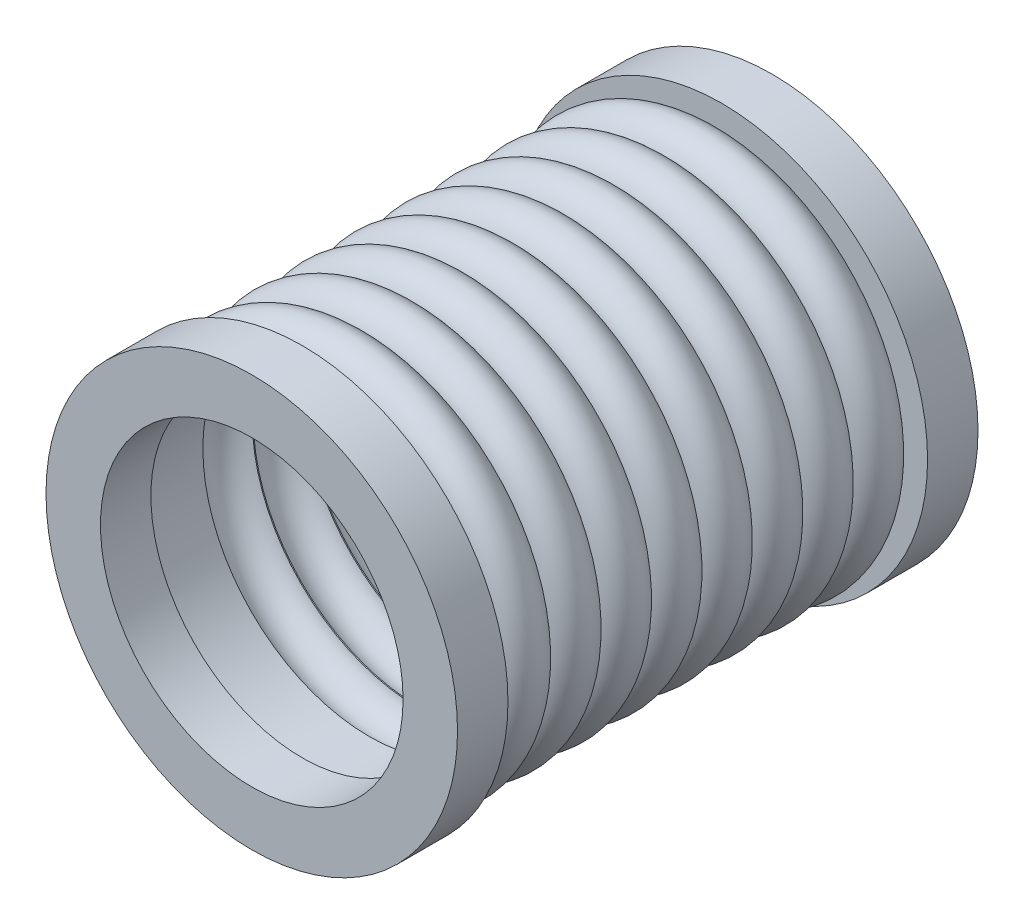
ISO-10303-21;
HEADER;
FILE_DESCRIPTION(('STEP AP214'),'2;1');
FILE_NAME('part.step','',(''),(''),'','','');
FILE_SCHEMA(('AUTOMOTIVE_DESIGN { 1 0 10303 214 1 1 1 1 }'));
ENDSEC;
DATA;
#1=APPLICATION_CONTEXT('core data for automotive mechanical design processes');
#2=APPLICATION_PROTOCOL_DEFINITION('international standard','automotive_design',2000,#1);
#3=PRODUCT_CONTEXT('',#1,'mechanical');
#4=PRODUCT('Part','Part','',(#3));
#5=PRODUCT_RELATED_PRODUCT_CATEGORY('part','',(#4));
#6=PRODUCT_DEFINITION_FORMATION('','',#4);
#7=PRODUCT_DEFINITION_CONTEXT('part definition',#1,'design');
#8=PRODUCT_DEFINITION('design','',#6,#7);
#9=PRODUCT_DEFINITION_SHAPE('','',#8);
#10=(LENGTH_UNIT() NAMED_UNIT(*) SI_UNIT(.MILLI.,.METRE.));
#11=(NAMED_UNIT(*) PLANE_ANGLE_UNIT() SI_UNIT($,.RADIAN.));
#12=(NAMED_UNIT(*) SI_UNIT($,.STERADIAN.) SOLID_ANGLE_UNIT());
#13=UNCERTAINTY_MEASURE_WITH_UNIT(LENGTH_MEASURE(1.E-05),#10,'distance_accuracy_value','');
#14=(GEOMETRIC_REPRESENTATION_CONTEXT(3) GLOBAL_UNCERTAINTY_ASSIGNED_CONTEXT((#13)) GLOBAL_UNIT_ASSIGNED_CONTEXT((#10,
#11,#12)) REPRESENTATION_CONTEXT('',''));
#15=CARTESIAN_POINT('',(0.,0.,0.));
#16=DIRECTION('',(0.,0.,1.));
#17=DIRECTION('',(1.,0.,0.));
#18=AXIS2_PLACEMENT_3D('',#15,#16,#17);
#19=CARTESIAN_POINT('',(0.,0.,26.416));
#20=DIRECTION('',(0.,0.,-1.));
#21=DIRECTION('',(-1.,0.,0.));
#22=AXIS2_PLACEMENT_3D('',#19,#20,#21);
#23=CYLINDRICAL_SURFACE('',#22,10.4775);
#24=CARTESIAN_POINT('',(0.,0.,19.0179259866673));
#25=DIRECTION('',(0.,0.,-1.));
#26=DIRECTION('',(-1.,0.,0.));
#27=AXIS2_PLACEMENT_3D('',#24,#25,#26);
#28=CIRCLE('',#27,10.4775);
#29=CARTESIAN_POINT('',(-10.4775,0.,19.0179259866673));
#30=VERTEX_POINT('',#29);
#31=EDGE_CURVE('E83',#30,#30,#28,.T.);
#32=CARTESIAN_POINT('',(0.,0.,19.0820740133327));
#33=DIRECTION('',(0.,0.,1.));
#34=DIRECTION('',(1.,0.,0.));
#35=AXIS2_PLACEMENT_3D('',#32,#33,#34);
#36=CIRCLE('',#35,10.4775);
#37=CARTESIAN_POINT('',(-10.4775,0.,19.0820740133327));
#38=VERTEX_POINT('',#37);
#39=EDGE_CURVE('E38',#38,#38,#36,.T.);
#40=CARTESIAN_POINT('',(-10.4775,0.,19.0179259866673));
#41=CARTESIAN_POINT('',(-10.4775,0.,19.0185941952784));
#42=CARTESIAN_POINT('',(-10.4775,0.,19.0192624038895));
#43=CARTESIAN_POINT('',(-10.4775,0.,19.0205988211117));
#44=CARTESIAN_POINT('',(-10.4775,0.,19.0212670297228));
#45=CARTESIAN_POINT('',(-10.4775,0.,19.022603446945));
#46=CARTESIAN_POINT('',(-10.4775,0.,19.0232716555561));
#47=CARTESIAN_POINT('',(-10.4775,0.,19.0246080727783));
#48=CARTESIAN_POINT('',(-10.4775,0.,19.0252762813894));
#49=CARTESIAN_POINT('',(-10.4775,0.,19.0266126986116));
#50=CARTESIAN_POINT('',(-10.4775,0.,19.0272809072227));
#51=CARTESIAN_POINT('',(-10.4775,0.,19.0286173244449));
#52=CARTESIAN_POINT('',(-10.4775,0.,19.029285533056));
#53=CARTESIAN_POINT('',(-10.4775,0.,19.0306219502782));
#54=CARTESIAN_POINT('',(-10.4775,0.,19.0312901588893));
#55=CARTESIAN_POINT('',(-10.4775,0.,19.0326265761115));
#56=CARTESIAN_POINT('',(-10.4775,0.,19.0332947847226));
#57=CARTESIAN_POINT('',(-10.4775,0.,19.0346312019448));
#58=CARTESIAN_POINT('',(-10.4775,0.,19.0352994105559));
#59=CARTESIAN_POINT('',(-10.4775,0.,19.036635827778));
#60=CARTESIAN_POINT('',(-10.4775,0.,19.0373040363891));
#61=CARTESIAN_POINT('',(-10.4775,0.,19.0386404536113));
#62=CARTESIAN_POINT('',(-10.4775,0.,19.0393086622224));
#63=CARTESIAN_POINT('',(-10.4775,0.,19.0406450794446));
#64=CARTESIAN_POINT('',(-10.4775,0.,19.0413132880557));
#65=CARTESIAN_POINT('',(-10.4775,0.,19.0426497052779));
#66=CARTESIAN_POINT('',(-10.4775,0.,19.043317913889));
#67=CARTESIAN_POINT('',(-10.4775,0.,19.0446543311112));
#68=CARTESIAN_POINT('',(-10.4775,0.,19.0453225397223));
#69=CARTESIAN_POINT('',(-10.4775,0.,19.0466589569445));
#70=CARTESIAN_POINT('',(-10.4775,0.,19.0473271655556));
#71=CARTESIAN_POINT('',(-10.4775,0.,19.0486635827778));
#72=CARTESIAN_POINT('',(-10.4775,0.,19.0493317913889));
#73=CARTESIAN_POINT('',(-10.4775,0.,19.0506682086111));
#74=CARTESIAN_POINT('',(-10.4775,0.,19.0513364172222));
#75=CARTESIAN_POINT('',(-10.4775,0.,19.0526728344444));
#76=CARTESIAN_POINT('',(-10.4775,0.,19.0533410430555));
#77=CARTESIAN_POINT('',(-10.4775,0.,19.0546774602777));
#78=CARTESIAN_POINT('',(-10.4775,0.,19.0553456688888));
#79=CARTESIAN_POINT('',(-10.4775,0.,19.056682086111));
#80=CARTESIAN_POINT('',(-10.4775,0.,19.0573502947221));
#81=CARTESIAN_POINT('',(-10.4775,0.,19.0586867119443));
#82=CARTESIAN_POINT('',(-10.4775,0.,19.0593549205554));
#83=CARTESIAN_POINT('',(-10.4775,0.,19.0606913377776));
#84=CARTESIAN_POINT('',(-10.4775,0.,19.0613595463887));
#85=CARTESIAN_POINT('',(-10.4775,0.,19.0626959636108));
#86=CARTESIAN_POINT('',(-10.4775,0.,19.0633641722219));
#87=CARTESIAN_POINT('',(-10.4775,0.,19.0647005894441));
#88=CARTESIAN_POINT('',(-10.4775,0.,19.0653687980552));
#89=CARTESIAN_POINT('',(-10.4775,0.,19.0667052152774));
#90=CARTESIAN_POINT('',(-10.4775,0.,19.0673734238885));
#91=CARTESIAN_POINT('',(-10.4775,0.,19.0687098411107));
#92=CARTESIAN_POINT('',(-10.4775,0.,19.0693780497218));
#93=CARTESIAN_POINT('',(-10.4775,0.,19.070714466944));
#94=CARTESIAN_POINT('',(-10.4775,0.,19.0713826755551));
#95=CARTESIAN_POINT('',(-10.4775,0.,19.0727190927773));
#96=CARTESIAN_POINT('',(-10.4775,0.,19.0733873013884));
#97=CARTESIAN_POINT('',(-10.4775,0.,19.0747237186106));
#98=CARTESIAN_POINT('',(-10.4775,0.,19.0753919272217));
#99=CARTESIAN_POINT('',(-10.4775,0.,19.0767283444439));
#100=CARTESIAN_POINT('',(-10.4775,0.,19.077396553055));
#101=CARTESIAN_POINT('',(-10.4775,0.,19.0787329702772));
#102=CARTESIAN_POINT('',(-10.4775,0.,19.0794011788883));
#103=CARTESIAN_POINT('',(-10.4775,0.,19.0807375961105));
#104=CARTESIAN_POINT('',(-10.4775,0.,19.0814058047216));
#105=CARTESIAN_POINT('',(-10.4775,0.,19.0820740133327));
#106=B_SPLINE_CURVE_WITH_KNOTS('',3,(#40,#41,#42,#43,#44,#45,#46,#47,#48,#49,#50,#51,#52,#53,
#54,#55,#56,#57,#58,#59,#60,#61,#62,#63,#64,#65,#66,#67,#68,#69,#70,#71,#72,#73,#74,#75,#76,#77,
#78,#79,#80,#81,#82,#83,#84,#85,#86,#87,#88,#89,#90,#91,#92,#93,#94,#95,#96,#97,#98,#99,#100,
#101,#102,#103,#104,#105),.UNSPECIFIED.,.F.,.F.,(4,2,2,2,2,2,2,2,2,2,2,2,2,2,2,2,2,2,2,2,2,2,2,
2,2,2,2,2,2,2,2,2,4),(0.,0.00200462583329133,0.00400925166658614,0.00601387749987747,
0.00801850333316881,0.0100231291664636,0.0120277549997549,0.0140323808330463,0.0160370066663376,
0.0180416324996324,0.0200462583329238,0.0220508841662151,0.0240555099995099,0.0260601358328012,
0.0280647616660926,0.0300693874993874,0.0320740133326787,0.03407863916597,0.0360832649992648,
0.0380878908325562,0.0400925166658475,0.0420971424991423,0.0441017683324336,0.046106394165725,
0.0481110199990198,0.0501156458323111,0.0521202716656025,0.0541248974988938,0.0561295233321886,
0.0581341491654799,0.0601387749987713,0.0621434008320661,0.0641480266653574),.UNSPECIFIED.);
#107=EDGE_CURVE('BSEAM34',#30,#38,#106,.T.);
#108=ORIENTED_EDGE('',*,*,#31,.T.);
#109=ORIENTED_EDGE('',*,*,#39,.T.);
#110=ORIENTED_EDGE('',*,*,#107,.T.);
#111=ORIENTED_EDGE('',*,*,#107,.F.);
#112=EDGE_LOOP('',(#108,#110,#109,#111));
#113=FACE_BOUND('',#112,.T.);
#114=ADVANCED_FACE('F34',(#113),#23,.F.);
#115=CARTESIAN_POINT('',(0.,0.,26.416));
#116=DIRECTION('',(0.,0.,1.));
#117=DIRECTION('',(1.,0.,0.));
#118=AXIS2_PLACEMENT_3D('',#115,#116,#117);
#119=CIRCLE('',#118,10.4775);
#120=CARTESIAN_POINT('',(-10.4775,0.,26.416));
#121=VERTEX_POINT('',#120);
#122=EDGE_CURVE('E432',#121,#121,#119,.T.);
#123=CARTESIAN_POINT('',(0.,0.,22.1929259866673));
#124=DIRECTION('',(0.,0.,-1.));
#125=DIRECTION('',(-1.,0.,0.));
#126=AXIS2_PLACEMENT_3D('',#123,#124,#125);
#127=CIRCLE('',#126,10.4775);
#128=CARTESIAN_POINT('',(-10.4775,0.,22.1929259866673));
#129=VERTEX_POINT('',#128);
#130=EDGE_CURVE('E87',#129,#129,#127,.T.);
#131=CARTESIAN_POINT('',(-10.4775,0.,26.416));
#132=CARTESIAN_POINT('',(-10.4775,0.,26.3720096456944));
#133=CARTESIAN_POINT('',(-10.4775,0.,26.3280192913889));
#134=CARTESIAN_POINT('',(-10.4775,0.,26.2400385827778));
#135=CARTESIAN_POINT('',(-10.4775,0.,26.1960482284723));
#136=CARTESIAN_POINT('',(-10.4775,0.,26.1080675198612));
#137=CARTESIAN_POINT('',(-10.4775,0.,26.0640771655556));
#138=CARTESIAN_POINT('',(-10.4775,0.,25.9760964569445));
#139=CARTESIAN_POINT('',(-10.4775,0.,25.932106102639));
#140=CARTESIAN_POINT('',(-10.4775,0.,25.8441253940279));
#141=CARTESIAN_POINT('',(-10.4775,0.,25.8001350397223));
#142=CARTESIAN_POINT('',(-10.4775,0.,25.7121543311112));
#143=CARTESIAN_POINT('',(-10.4775,0.,25.6681639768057));
#144=CARTESIAN_POINT('',(-10.4775,0.,25.5801832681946));
#145=CARTESIAN_POINT('',(-10.4775,0.,25.536192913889));
#146=CARTESIAN_POINT('',(-10.4775,0.,25.4482122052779));
#147=CARTESIAN_POINT('',(-10.4775,0.,25.4042218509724));
#148=CARTESIAN_POINT('',(-10.4775,0.,25.3162411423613));
#149=CARTESIAN_POINT('',(-10.4775,0.,25.2722507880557));
#150=CARTESIAN_POINT('',(-10.4775,0.,25.1842700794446));
#151=CARTESIAN_POINT('',(-10.4775,0.,25.1402797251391));
#152=CARTESIAN_POINT('',(-10.4775,0.,25.052299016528));
#153=CARTESIAN_POINT('',(-10.4775,0.,25.0083086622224));
#154=CARTESIAN_POINT('',(-10.4775,0.,24.9203279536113));
#155=CARTESIAN_POINT('',(-10.4775,0.,24.8763375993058));
#156=CARTESIAN_POINT('',(-10.4775,0.,24.7883568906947));
#157=CARTESIAN_POINT('',(-10.4775,0.,24.7443665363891));
#158=CARTESIAN_POINT('',(-10.4775,0.,24.656385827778));
#159=CARTESIAN_POINT('',(-10.4775,0.,24.6123954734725));
#160=CARTESIAN_POINT('',(-10.4775,0.,24.5244147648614));
#161=CARTESIAN_POINT('',(-10.4775,0.,24.4804244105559));
#162=CARTESIAN_POINT('',(-10.4775,0.,24.3924437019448));
#163=CARTESIAN_POINT('',(-10.4775,0.,24.3484533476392));
#164=CARTESIAN_POINT('',(-10.4775,0.,24.2604726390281));
#165=CARTESIAN_POINT('',(-10.4775,0.,24.2164822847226));
#166=CARTESIAN_POINT('',(-10.4775,0.,24.1285015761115));
#167=CARTESIAN_POINT('',(-10.4775,0.,24.0845112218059));
#168=CARTESIAN_POINT('',(-10.4775,0.,23.9965305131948));
#169=CARTESIAN_POINT('',(-10.4775,0.,23.9525401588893));
#170=CARTESIAN_POINT('',(-10.4775,0.,23.8645594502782));
#171=CARTESIAN_POINT('',(-10.4775,0.,23.8205690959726));
#172=CARTESIAN_POINT('',(-10.4775,0.,23.7325883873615));
#173=CARTESIAN_POINT('',(-10.4775,0.,23.688598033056));
#174=CARTESIAN_POINT('',(-10.4775,0.,23.6006173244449));
#175=CARTESIAN_POINT('',(-10.4775,0.,23.5566269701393));
#176=CARTESIAN_POINT('',(-10.4775,0.,23.4686462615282));
#177=CARTESIAN_POINT('',(-10.4775,0.,23.4246559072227));
#178=CARTESIAN_POINT('',(-10.4775,0.,23.3366751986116));
#179=CARTESIAN_POINT('',(-10.4775,0.,23.292684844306));
#180=CARTESIAN_POINT('',(-10.4775,0.,23.2047041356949));
#181=CARTESIAN_POINT('',(-10.4775,0.,23.1607137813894));
#182=CARTESIAN_POINT('',(-10.4775,0.,23.0727330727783));
#183=CARTESIAN_POINT('',(-10.4775,0.,23.0287427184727));
#184=CARTESIAN_POINT('',(-10.4775,0.,22.9407620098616));
#185=CARTESIAN_POINT('',(-10.4775,0.,22.8967716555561));
#186=CARTESIAN_POINT('',(-10.4775,0.,22.808790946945));
#187=CARTESIAN_POINT('',(-10.4775,0.,22.7648005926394));
#188=CARTESIAN_POINT('',(-10.4775,0.,22.6768198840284));
#189=CARTESIAN_POINT('',(-10.4775,0.,22.6328295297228));
#190=CARTESIAN_POINT('',(-10.4775,0.,22.5448488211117));
#191=CARTESIAN_POINT('',(-10.4775,0.,22.5008584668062));
#192=CARTESIAN_POINT('',(-10.4775,0.,22.4128777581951));
#193=CARTESIAN_POINT('',(-10.4775,0.,22.3688874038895));
#194=CARTESIAN_POINT('',(-10.4775,0.,22.2809066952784));
#195=CARTESIAN_POINT('',(-10.4775,0.,22.2369163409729));
#196=CARTESIAN_POINT('',(-10.4775,0.,22.1929259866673));
#197=B_SPLINE_CURVE_WITH_KNOTS('',3,(#131,#132,#133,#134,#135,#136,#137,#138,#139,#140,#141,
#142,#143,#144,#145,#146,#147,#148,#149,#150,#151,#152,#153,#154,#155,#156,#157,#158,#159,#160,
#161,#162,#163,#164,#165,#166,#167,#168,#169,#170,#171,#172,#173,#174,#175,#176,#177,#178,#179,
#180,#181,#182,#183,#184,#185,#186,#187,#188,#189,#190,#191,#192,#193,#194,#195,#196),
.UNSPECIFIED.,.F.,.F.,(4,2,2,2,2,2,2,2,2,2,2,2,2,2,2,2,2,2,2,2,2,2,2,2,2,2,2,2,2,2,2,2,4),(0.,
0.131971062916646,0.263942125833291,0.395913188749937,0.527884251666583,0.659855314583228,
0.791826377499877,0.923797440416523,1.05576850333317,1.18773956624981,1.31971062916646,
1.45168169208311,1.58365275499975,1.7156238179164,1.84759488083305,1.97956594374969,
2.11153700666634,2.24350806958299,2.37547913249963,2.50745019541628,2.63942125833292,
2.77139232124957,2.90336338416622,3.03533444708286,3.16730550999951,3.29927657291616,
3.4312476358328,3.56321869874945,3.6951897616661,3.82716082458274,3.95913188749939,
4.09110295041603,4.22307401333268),.UNSPECIFIED.);
#198=EDGE_CURVE('BSEAM146',#121,#129,#197,.T.);
#199=ORIENTED_EDGE('',*,*,#122,.T.);
#200=ORIENTED_EDGE('',*,*,#130,.T.);
#201=ORIENTED_EDGE('',*,*,#198,.T.);
#202=ORIENTED_EDGE('',*,*,#198,.F.);
#203=EDGE_LOOP('',(#199,#201,#200,#202));
#204=FACE_BOUND('',#203,.T.);
#205=ADVANCED_FACE('F146',(#204),#23,.F.);
#206=CARTESIAN_POINT('',(0.,0.,15.8429259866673));
#207=DIRECTION('',(0.,0.,-1.));
#208=DIRECTION('',(-1.,0.,0.));
#209=AXIS2_PLACEMENT_3D('',#206,#207,#208);
#210=CIRCLE('',#209,10.4775);
#211=CARTESIAN_POINT('',(-10.4775,0.,15.8429259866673));
#212=VERTEX_POINT('',#211);
#213=EDGE_CURVE('E77',#212,#212,#210,.T.);
#214=CARTESIAN_POINT('',(0.,0.,15.9070740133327));
#215=DIRECTION('',(0.,0.,1.));
#216=DIRECTION('',(1.,0.,0.));
#217=AXIS2_PLACEMENT_3D('',#214,#215,#216);
#218=CIRCLE('',#217,10.4775);
#219=CARTESIAN_POINT('',(-10.4775,0.,15.9070740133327));
#220=VERTEX_POINT('',#219);
#221=EDGE_CURVE('E80',#220,#220,#218,.T.);
#222=CARTESIAN_POINT('',(-10.4775,0.,15.8429259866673));
#223=CARTESIAN_POINT('',(-10.4775,0.,15.8435941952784));
#224=CARTESIAN_POINT('',(-10.4775,0.,15.8442624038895));
#225=CARTESIAN_POINT('',(-10.4775,0.,15.8455988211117));
#226=CARTESIAN_POINT('',(-10.4775,0.,15.8462670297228));
#227=CARTESIAN_POINT('',(-10.4775,0.,15.847603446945));
#228=CARTESIAN_POINT('',(-10.4775,0.,15.8482716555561));
#229=CARTESIAN_POINT('',(-10.4775,0.,15.8496080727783));
#230=CARTESIAN_POINT('',(-10.4775,0.,15.8502762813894));
#231=CARTESIAN_POINT('',(-10.4775,0.,15.8516126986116));
#232=CARTESIAN_POINT('',(-10.4775,0.,15.8522809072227));
#233=CARTESIAN_POINT('',(-10.4775,0.,15.8536173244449));
#234=CARTESIAN_POINT('',(-10.4775,0.,15.854285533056));
#235=CARTESIAN_POINT('',(-10.4775,0.,15.8556219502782));
#236=CARTESIAN_POINT('',(-10.4775,0.,15.8562901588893));
#237=CARTESIAN_POINT('',(-10.4775,0.,15.8576265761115));
#238=CARTESIAN_POINT('',(-10.4775,0.,15.8582947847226));
#239=CARTESIAN_POINT('',(-10.4775,0.,15.8596312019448));
#240=CARTESIAN_POINT('',(-10.4775,0.,15.8602994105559));
#241=CARTESIAN_POINT('',(-10.4775,0.,15.8616358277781));
#242=CARTESIAN_POINT('',(-10.4775,0.,15.8623040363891));
#243=CARTESIAN_POINT('',(-10.4775,0.,15.8636404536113));
#244=CARTESIAN_POINT('',(-10.4775,0.,15.8643086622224));
#245=CARTESIAN_POINT('',(-10.4775,0.,15.8656450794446));
#246=CARTESIAN_POINT('',(-10.4775,0.,15.8663132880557));
#247=CARTESIAN_POINT('',(-10.4775,0.,15.8676497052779));
#248=CARTESIAN_POINT('',(-10.4775,0.,15.868317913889));
#249=CARTESIAN_POINT('',(-10.4775,0.,15.8696543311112));
#250=CARTESIAN_POINT('',(-10.4775,0.,15.8703225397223));
#251=CARTESIAN_POINT('',(-10.4775,0.,15.8716589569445));
#252=CARTESIAN_POINT('',(-10.4775,0.,15.8723271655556));
#253=CARTESIAN_POINT('',(-10.4775,0.,15.8736635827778));
#254=CARTESIAN_POINT('',(-10.4775,0.,15.8743317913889));
#255=CARTESIAN_POINT('',(-10.4775,0.,15.8756682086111));
#256=CARTESIAN_POINT('',(-10.4775,0.,15.8763364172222));
#257=CARTESIAN_POINT('',(-10.4775,0.,15.8776728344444));
#258=CARTESIAN_POINT('',(-10.4775,0.,15.8783410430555));
#259=CARTESIAN_POINT('',(-10.4775,0.,15.8796774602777));
#260=CARTESIAN_POINT('',(-10.4775,0.,15.8803456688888));
#261=CARTESIAN_POINT('',(-10.4775,0.,15.881682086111));
#262=CARTESIAN_POINT('',(-10.4775,0.,15.8823502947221));
#263=CARTESIAN_POINT('',(-10.4775,0.,15.8836867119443));
#264=CARTESIAN_POINT('',(-10.4775,0.,15.8843549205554));
#265=CARTESIAN_POINT('',(-10.4775,0.,15.8856913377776));
#266=CARTESIAN_POINT('',(-10.4775,0.,15.8863595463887));
#267=CARTESIAN_POINT('',(-10.4775,0.,15.8876959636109));
#268=CARTESIAN_POINT('',(-10.4775,0.,15.8883641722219));
#269=CARTESIAN_POINT('',(-10.4775,0.,15.8897005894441));
#270=CARTESIAN_POINT('',(-10.4775,0.,15.8903687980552));
#271=CARTESIAN_POINT('',(-10.4775,0.,15.8917052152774));
#272=CARTESIAN_POINT('',(-10.4775,0.,15.8923734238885));
#273=CARTESIAN_POINT('',(-10.4775,0.,15.8937098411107));
#274=CARTESIAN_POINT('',(-10.4775,0.,15.8943780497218));
#275=CARTESIAN_POINT('',(-10.4775,0.,15.895714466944));
#276=CARTESIAN_POINT('',(-10.4775,0.,15.8963826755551));
#277=CARTESIAN_POINT('',(-10.4775,0.,15.8977190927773));
#278=CARTESIAN_POINT('',(-10.4775,0.,15.8983873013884));
#279=CARTESIAN_POINT('',(-10.4775,0.,15.8997237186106));
#280=CARTESIAN_POINT('',(-10.4775,0.,15.9003919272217));
#281=CARTESIAN_POINT('',(-10.4775,0.,15.9017283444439));
#282=CARTESIAN_POINT('',(-10.4775,0.,15.902396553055));
#283=CARTESIAN_POINT('',(-10.4775,0.,15.9037329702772));
#284=CARTESIAN_POINT('',(-10.4775,0.,15.9044011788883));
#285=CARTESIAN_POINT('',(-10.4775,0.,15.9057375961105));
#286=CARTESIAN_POINT('',(-10.4775,0.,15.9064058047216));
#287=CARTESIAN_POINT('',(-10.4775,0.,15.9070740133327));
#288=B_SPLINE_CURVE_WITH_KNOTS('',3,(#222,#223,#224,#225,#226,#227,#228,#229,#230,#231,#232,
#233,#234,#235,#236,#237,#238,#239,#240,#241,#242,#243,#244,#245,#246,#247,#248,#249,#250,#251,
#252,#253,#254,#255,#256,#257,#258,#259,#260,#261,#262,#263,#264,#265,#266,#267,#268,#269,#270,
#271,#272,#273,#274,#275,#276,#277,#278,#279,#280,#281,#282,#283,#284,#285,#286,#287),
.UNSPECIFIED.,.F.,.F.,(4,2,2,2,2,2,2,2,2,2,2,2,2,2,2,2,2,2,2,2,2,2,2,2,2,2,2,2,2,2,2,2,4),(0.,
0.0020046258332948,0.00400925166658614,0.00601387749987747,0.00801850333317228,
0.0100231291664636,0.0120277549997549,0.0140323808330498,0.0160370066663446,0.0180416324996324,
0.0200462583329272,0.022050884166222,0.0240555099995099,0.0260601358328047,0.0280647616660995,
0.0300693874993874,0.0320740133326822,0.034078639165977,0.0360832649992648,0.0380878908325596,
0.0400925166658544,0.0420971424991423,0.0441017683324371,0.0461063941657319,0.0481110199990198,
0.0501156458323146,0.0521202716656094,0.0541248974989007,0.0561295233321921,0.0581341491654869,
0.0601387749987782,0.0621434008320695,0.0641480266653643),.UNSPECIFIED.);
#289=EDGE_CURVE('BSEAM151',#212,#220,#288,.T.);
#290=ORIENTED_EDGE('',*,*,#213,.T.);
#291=ORIENTED_EDGE('',*,*,#221,.T.);
#292=ORIENTED_EDGE('',*,*,#289,.T.);
#293=ORIENTED_EDGE('',*,*,#289,.F.);
#294=EDGE_LOOP('',(#290,#292,#291,#293));
#295=FACE_BOUND('',#294,.T.);
#296=ADVANCED_FACE('F151',(#295),#23,.F.);
#297=CARTESIAN_POINT('',(0.,0.,12.6679259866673));
#298=DIRECTION('',(0.,0.,-1.));
#299=DIRECTION('',(-1.,0.,0.));
#300=AXIS2_PLACEMENT_3D('',#297,#298,#299);
#301=CIRCLE('',#300,10.4775);
#302=CARTESIAN_POINT('',(-10.4775,0.,12.6679259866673));
#303=VERTEX_POINT('',#302);
#304=EDGE_CURVE('E71',#303,#303,#301,.T.);
#305=CARTESIAN_POINT('',(0.,0.,12.7320740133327));
#306=DIRECTION('',(0.,0.,1.));
#307=DIRECTION('',(1.,0.,0.));
#308=AXIS2_PLACEMENT_3D('',#305,#306,#307);
#309=CIRCLE('',#308,10.4775);
#310=CARTESIAN_POINT('',(-10.4775,0.,12.7320740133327));
#311=VERTEX_POINT('',#310);
#312=EDGE_CURVE('E74',#311,#311,#309,.T.);
#313=CARTESIAN_POINT('',(-10.4775,0.,12.6679259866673));
#314=CARTESIAN_POINT('',(-10.4775,0.,12.6685941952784));
#315=CARTESIAN_POINT('',(-10.4775,0.,12.6692624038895));
#316=CARTESIAN_POINT('',(-10.4775,0.,12.6705988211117));
#317=CARTESIAN_POINT('',(-10.4775,0.,12.6712670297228));
#318=CARTESIAN_POINT('',(-10.4775,0.,12.672603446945));
#319=CARTESIAN_POINT('',(-10.4775,0.,12.6732716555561));
#320=CARTESIAN_POINT('',(-10.4775,0.,12.6746080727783));
#321=CARTESIAN_POINT('',(-10.4775,0.,12.6752762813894));
#322=CARTESIAN_POINT('',(-10.4775,0.,12.6766126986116));
#323=CARTESIAN_POINT('',(-10.4775,0.,12.6772809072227));
#324=CARTESIAN_POINT('',(-10.4775,0.,12.6786173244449));
#325=CARTESIAN_POINT('',(-10.4775,0.,12.679285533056));
#326=CARTESIAN_POINT('',(-10.4775,0.,12.6806219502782));
#327=CARTESIAN_POINT('',(-10.4775,0.,12.6812901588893));
#328=CARTESIAN_POINT('',(-10.4775,0.,12.6826265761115));
#329=CARTESIAN_POINT('',(-10.4775,0.,12.6832947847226));
#330=CARTESIAN_POINT('',(-10.4775,0.,12.6846312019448));
#331=CARTESIAN_POINT('',(-10.4775,0.,12.6852994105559));
#332=CARTESIAN_POINT('',(-10.4775,0.,12.686635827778));
#333=CARTESIAN_POINT('',(-10.4775,0.,12.6873040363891));
#334=CARTESIAN_POINT('',(-10.4775,0.,12.6886404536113));
#335=CARTESIAN_POINT('',(-10.4775,0.,12.6893086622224));
#336=CARTESIAN_POINT('',(-10.4775,0.,12.6906450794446));
#337=CARTESIAN_POINT('',(-10.4775,0.,12.6913132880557));
#338=CARTESIAN_POINT('',(-10.4775,0.,12.6926497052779));
#339=CARTESIAN_POINT('',(-10.4775,0.,12.693317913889));
#340=CARTESIAN_POINT('',(-10.4775,0.,12.6946543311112));
#341=CARTESIAN_POINT('',(-10.4775,0.,12.6953225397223));
#342=CARTESIAN_POINT('',(-10.4775,0.,12.6966589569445));
#343=CARTESIAN_POINT('',(-10.4775,0.,12.6973271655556));
#344=CARTESIAN_POINT('',(-10.4775,0.,12.6986635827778));
#345=CARTESIAN_POINT('',(-10.4775,0.,12.6993317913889));
#346=CARTESIAN_POINT('',(-10.4775,0.,12.7006682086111));
#347=CARTESIAN_POINT('',(-10.4775,0.,12.7013364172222));
#348=CARTESIAN_POINT('',(-10.4775,0.,12.7026728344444));
#349=CARTESIAN_POINT('',(-10.4775,0.,12.7033410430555));
#350=CARTESIAN_POINT('',(-10.4775,0.,12.7046774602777));
#351=CARTESIAN_POINT('',(-10.4775,0.,12.7053456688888));
#352=CARTESIAN_POINT('',(-10.4775,0.,12.706682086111));
#353=CARTESIAN_POINT('',(-10.4775,0.,12.7073502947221));
#354=CARTESIAN_POINT('',(-10.4775,0.,12.7086867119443));
#355=CARTESIAN_POINT('',(-10.4775,0.,12.7093549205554));
#356=CARTESIAN_POINT('',(-10.4775,0.,12.7106913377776));
#357=CARTESIAN_POINT('',(-10.4775,0.,12.7113595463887));
#358=CARTESIAN_POINT('',(-10.4775,0.,12.7126959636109));
#359=CARTESIAN_POINT('',(-10.4775,0.,12.7133641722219));
#360=CARTESIAN_POINT('',(-10.4775,0.,12.7147005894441));
#361=CARTESIAN_POINT('',(-10.4775,0.,12.7153687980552));
#362=CARTESIAN_POINT('',(-10.4775,0.,12.7167052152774));
#363=CARTESIAN_POINT('',(-10.4775,0.,12.7173734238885));
#364=CARTESIAN_POINT('',(-10.4775,0.,12.7187098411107));
#365=CARTESIAN_POINT('',(-10.4775,0.,12.7193780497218));
#366=CARTESIAN_POINT('',(-10.4775,0.,12.720714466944));
#367=CARTESIAN_POINT('',(-10.4775,0.,12.7213826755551));
#368=CARTESIAN_POINT('',(-10.4775,0.,12.7227190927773));
#369=CARTESIAN_POINT('',(-10.4775,0.,12.7233873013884));
#370=CARTESIAN_POINT('',(-10.4775,0.,12.7247237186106));
#371=CARTESIAN_POINT('',(-10.4775,0.,12.7253919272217));
#372=CARTESIAN_POINT('',(-10.4775,0.,12.7267283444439));
#373=CARTESIAN_POINT('',(-10.4775,0.,12.727396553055));
#374=CARTESIAN_POINT('',(-10.4775,0.,12.7287329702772));
#375=CARTESIAN_POINT('',(-10.4775,0.,12.7294011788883));
#376=CARTESIAN_POINT('',(-10.4775,0.,12.7307375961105));
#377=CARTESIAN_POINT('',(-10.4775,0.,12.7314058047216));
#378=CARTESIAN_POINT('',(-10.4775,0.,12.7320740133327));
#379=B_SPLINE_CURVE_WITH_KNOTS('',3,(#313,#314,#315,#316,#317,#318,#319,#320,#321,#322,#323,
#324,#325,#326,#327,#328,#329,#330,#331,#332,#333,#334,#335,#336,#337,#338,#339,#340,#341,#342,
#343,#344,#345,#346,#347,#348,#349,#350,#351,#352,#353,#354,#355,#356,#357,#358,#359,#360,#361,
#362,#363,#364,#365,#366,#367,#368,#369,#370,#371,#372,#373,#374,#375,#376,#377,#378),
.UNSPECIFIED.,.F.,.F.,(4,2,2,2,2,2,2,2,2,2,2,2,2,2,2,2,2,2,2,2,2,2,2,2,2,2,2,2,2,2,2,2,4),(0.,
0.00200462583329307,0.0040092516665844,0.00601387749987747,0.00801850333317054,
0.0100231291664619,0.0120277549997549,0.014032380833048,0.0160370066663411,0.0180416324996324,
0.0200462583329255,0.0220508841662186,0.0240555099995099,0.026060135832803,0.028064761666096,
0.0300693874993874,0.0320740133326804,0.0340786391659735,0.0360832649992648,0.0380878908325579,
0.040092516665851,0.0420971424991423,0.0441017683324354,0.0461063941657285,0.0481110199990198,
0.0501156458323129,0.0521202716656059,0.054124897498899,0.0561295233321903,0.0581341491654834,
0.0601387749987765,0.0621434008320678,0.0641480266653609),.UNSPECIFIED.);
#380=EDGE_CURVE('BSEAM194',#303,#311,#379,.T.);
#381=ORIENTED_EDGE('',*,*,#304,.T.);
#382=ORIENTED_EDGE('',*,*,#312,.T.);
#383=ORIENTED_EDGE('',*,*,#380,.T.);
#384=ORIENTED_EDGE('',*,*,#380,.F.);
#385=EDGE_LOOP('',(#381,#383,#382,#384));
#386=FACE_BOUND('',#385,.T.);
#387=ADVANCED_FACE('F194',(#386),#23,.F.);
#388=CARTESIAN_POINT('',(0.,0.,9.49292598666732));
#389=DIRECTION('',(0.,0.,-1.));
#390=DIRECTION('',(-1.,0.,0.));
#391=AXIS2_PLACEMENT_3D('',#388,#389,#390);
#392=CIRCLE('',#391,10.4775);
#393=CARTESIAN_POINT('',(-10.4775,0.,9.49292598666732));
#394=VERTEX_POINT('',#393);
#395=EDGE_CURVE('E65',#394,#394,#392,.T.);
#396=CARTESIAN_POINT('',(0.,0.,9.55707401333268));
#397=DIRECTION('',(0.,0.,1.));
#398=DIRECTION('',(1.,0.,0.));
#399=AXIS2_PLACEMENT_3D('',#396,#397,#398);
#400=CIRCLE('',#399,10.4775);
#401=CARTESIAN_POINT('',(-10.4775,0.,9.55707401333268));
#402=VERTEX_POINT('',#401);
#403=EDGE_CURVE('E68',#402,#402,#400,.T.);
#404=CARTESIAN_POINT('',(-10.4775,0.,9.49292598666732));
#405=CARTESIAN_POINT('',(-10.4775,0.,9.49359419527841));
#406=CARTESIAN_POINT('',(-10.4775,0.,9.49426240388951));
#407=CARTESIAN_POINT('',(-10.4775,0.,9.49559882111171));
#408=CARTESIAN_POINT('',(-10.4775,0.,9.49626702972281));
#409=CARTESIAN_POINT('',(-10.4775,0.,9.497603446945));
#410=CARTESIAN_POINT('',(-10.4775,0.,9.4982716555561));
#411=CARTESIAN_POINT('',(-10.4775,0.,9.49960807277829));
#412=CARTESIAN_POINT('',(-10.4775,0.,9.50027628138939));
#413=CARTESIAN_POINT('',(-10.4775,0.,9.50161269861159));
#414=CARTESIAN_POINT('',(-10.4775,0.,9.50228090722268));
#415=CARTESIAN_POINT('',(-10.4775,0.,9.50361732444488));
#416=CARTESIAN_POINT('',(-10.4775,0.,9.50428553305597));
#417=CARTESIAN_POINT('',(-10.4775,0.,9.50562195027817));
#418=CARTESIAN_POINT('',(-10.4775,0.,9.50629015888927));
#419=CARTESIAN_POINT('',(-10.4775,0.,9.50762657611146));
#420=CARTESIAN_POINT('',(-10.4775,0.,9.50829478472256));
#421=CARTESIAN_POINT('',(-10.4775,0.,9.50963120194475));
#422=CARTESIAN_POINT('',(-10.4775,0.,9.51029941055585));
#423=CARTESIAN_POINT('',(-10.4775,0.,9.51163582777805));
#424=CARTESIAN_POINT('',(-10.4775,0.,9.51230403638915));
#425=CARTESIAN_POINT('',(-10.4775,0.,9.51364045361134));
#426=CARTESIAN_POINT('',(-10.4775,0.,9.51430866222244));
#427=CARTESIAN_POINT('',(-10.4775,0.,9.51564507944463));
#428=CARTESIAN_POINT('',(-10.4775,0.,9.51631328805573));
#429=CARTESIAN_POINT('',(-10.4775,0.,9.51764970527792));
#430=CARTESIAN_POINT('',(-10.4775,0.,9.51831791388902));
#431=CARTESIAN_POINT('',(-10.4775,0.,9.51965433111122));
#432=CARTESIAN_POINT('',(-10.4775,0.,9.52032253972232));
#433=CARTESIAN_POINT('',(-10.4775,0.,9.52165895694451));
#434=CARTESIAN_POINT('',(-10.4775,0.,9.52232716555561));
#435=CARTESIAN_POINT('',(-10.4775,0.,9.52366358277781));
#436=CARTESIAN_POINT('',(-10.4775,0.,9.5243317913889));
#437=CARTESIAN_POINT('',(-10.4775,0.,9.5256682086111));
#438=CARTESIAN_POINT('',(-10.4775,0.,9.52633641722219));
#439=CARTESIAN_POINT('',(-10.4775,0.,9.52767283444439));
#440=CARTESIAN_POINT('',(-10.4775,0.,9.52834104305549));
#441=CARTESIAN_POINT('',(-10.4775,0.,9.52967746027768));
#442=CARTESIAN_POINT('',(-10.4775,0.,9.53034566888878));
#443=CARTESIAN_POINT('',(-10.4775,0.,9.53168208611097));
#444=CARTESIAN_POINT('',(-10.4775,0.,9.53235029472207));
#445=CARTESIAN_POINT('',(-10.4775,0.,9.53368671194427));
#446=CARTESIAN_POINT('',(-10.4775,0.,9.53435492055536));
#447=CARTESIAN_POINT('',(-10.4775,0.,9.53569133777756));
#448=CARTESIAN_POINT('',(-10.4775,0.,9.53635954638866));
#449=CARTESIAN_POINT('',(-10.4775,0.,9.53769596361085));
#450=CARTESIAN_POINT('',(-10.4775,0.,9.53836417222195));
#451=CARTESIAN_POINT('',(-10.4775,0.,9.53970058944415));
#452=CARTESIAN_POINT('',(-10.4775,0.,9.54036879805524));
#453=CARTESIAN_POINT('',(-10.4775,0.,9.54170521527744));
#454=CARTESIAN_POINT('',(-10.4775,0.,9.54237342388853));
#455=CARTESIAN_POINT('',(-10.4775,0.,9.54370984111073));
#456=CARTESIAN_POINT('',(-10.4775,0.,9.54437804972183));
#457=CARTESIAN_POINT('',(-10.4775,0.,9.54571446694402));
#458=CARTESIAN_POINT('',(-10.4775,0.,9.54638267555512));
#459=CARTESIAN_POINT('',(-10.4775,0.,9.54771909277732));
#460=CARTESIAN_POINT('',(-10.4775,0.,9.54838730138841));
#461=CARTESIAN_POINT('',(-10.4775,0.,9.54972371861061));
#462=CARTESIAN_POINT('',(-10.4775,0.,9.55039192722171));
#463=CARTESIAN_POINT('',(-10.4775,0.,9.5517283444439));
#464=CARTESIAN_POINT('',(-10.4775,0.,9.552396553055));
#465=CARTESIAN_POINT('',(-10.4775,0.,9.55373297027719));
#466=CARTESIAN_POINT('',(-10.4775,0.,9.55440117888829));
#467=CARTESIAN_POINT('',(-10.4775,0.,9.55573759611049));
#468=CARTESIAN_POINT('',(-10.4775,0.,9.55640580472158));
#469=CARTESIAN_POINT('',(-10.4775,0.,9.55707401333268));
#470=B_SPLINE_CURVE_WITH_KNOTS('',3,(#404,#405,#406,#407,#408,#409,#410,#411,#412,#413,#414,
#415,#416,#417,#418,#419,#420,#421,#422,#423,#424,#425,#426,#427,#428,#429,#430,#431,#432,#433,
#434,#435,#436,#437,#438,#439,#440,#441,#442,#443,#444,#445,#446,#447,#448,#449,#450,#451,#452,
#453,#454,#455,#456,#457,#458,#459,#460,#461,#462,#463,#464,#465,#466,#467,#468,#469),
.UNSPECIFIED.,.F.,.F.,(4,2,2,2,2,2,2,2,2,2,2,2,2,2,2,2,2,2,2,2,2,2,2,2,2,2,2,2,2,2,2,2,4),(0.,
0.00200462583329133,0.00400925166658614,0.00601387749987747,0.00801850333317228,
0.0100231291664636,0.0120277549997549,0.0140323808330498,0.0160370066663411,0.0180416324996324,
0.0200462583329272,0.0220508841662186,0.0240555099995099,0.0260601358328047,0.028064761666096,
0.0300693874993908,0.0320740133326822,0.0340786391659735,0.0360832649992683,0.0380878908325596,
0.0400925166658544,0.0420971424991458,0.0441017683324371,0.0461063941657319,0.0481110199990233,
0.0501156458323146,0.0521202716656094,0.0541248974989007,0.0561295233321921,0.0581341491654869,
0.0601387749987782,0.062143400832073,0.0641480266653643),.UNSPECIFIED.);
#471=EDGE_CURVE('BSEAM183',#394,#402,#470,.T.);
#472=ORIENTED_EDGE('',*,*,#395,.T.);
#473=ORIENTED_EDGE('',*,*,#403,.T.);
#474=ORIENTED_EDGE('',*,*,#471,.T.);
#475=ORIENTED_EDGE('',*,*,#471,.F.);
#476=EDGE_LOOP('',(#472,#474,#473,#475));
#477=FACE_BOUND('',#476,.T.);
#478=ADVANCED_FACE('F183',(#477),#23,.F.);
#479=CARTESIAN_POINT('',(0.,0.,6.31792598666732));
#480=DIRECTION('',(0.,0.,-1.));
#481=DIRECTION('',(-1.,0.,0.));
#482=AXIS2_PLACEMENT_3D('',#479,#480,#481);
#483=CIRCLE('',#482,10.4775);
#484=CARTESIAN_POINT('',(-10.4775,0.,6.31792598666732));
#485=VERTEX_POINT('',#484);
#486=EDGE_CURVE('E59',#485,#485,#483,.T.);
#487=CARTESIAN_POINT('',(0.,0.,6.38207401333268));
#488=DIRECTION('',(0.,0.,1.));
#489=DIRECTION('',(1.,0.,0.));
#490=AXIS2_PLACEMENT_3D('',#487,#488,#489);
#491=CIRCLE('',#490,10.4775);
#492=CARTESIAN_POINT('',(-10.4775,0.,6.38207401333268));
#493=VERTEX_POINT('',#492);
#494=EDGE_CURVE('E62',#493,#493,#491,.T.);
#495=CARTESIAN_POINT('',(-10.4775,0.,6.31792598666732));
#496=CARTESIAN_POINT('',(-10.4775,0.,6.31859419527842));
#497=CARTESIAN_POINT('',(-10.4775,0.,6.31926240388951));
#498=CARTESIAN_POINT('',(-10.4775,0.,6.32059882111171));
#499=CARTESIAN_POINT('',(-10.4775,0.,6.32126702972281));
#500=CARTESIAN_POINT('',(-10.4775,0.,6.322603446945));
#501=CARTESIAN_POINT('',(-10.4775,0.,6.3232716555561));
#502=CARTESIAN_POINT('',(-10.4775,0.,6.32460807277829));
#503=CARTESIAN_POINT('',(-10.4775,0.,6.32527628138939));
#504=CARTESIAN_POINT('',(-10.4775,0.,6.32661269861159));
#505=CARTESIAN_POINT('',(-10.4775,0.,6.32728090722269));
#506=CARTESIAN_POINT('',(-10.4775,0.,6.32861732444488));
#507=CARTESIAN_POINT('',(-10.4775,0.,6.32928553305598));
#508=CARTESIAN_POINT('',(-10.4775,0.,6.33062195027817));
#509=CARTESIAN_POINT('',(-10.4775,0.,6.33129015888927));
#510=CARTESIAN_POINT('',(-10.4775,0.,6.33262657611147));
#511=CARTESIAN_POINT('',(-10.4775,0.,6.33329478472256));
#512=CARTESIAN_POINT('',(-10.4775,0.,6.33463120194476));
#513=CARTESIAN_POINT('',(-10.4775,0.,6.33529941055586));
#514=CARTESIAN_POINT('',(-10.4775,0.,6.33663582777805));
#515=CARTESIAN_POINT('',(-10.4775,0.,6.33730403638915));
#516=CARTESIAN_POINT('',(-10.4775,0.,6.33864045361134));
#517=CARTESIAN_POINT('',(-10.4775,0.,6.33930866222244));
#518=CARTESIAN_POINT('',(-10.4775,0.,6.34064507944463));
#519=CARTESIAN_POINT('',(-10.4775,0.,6.34131328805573));
#520=CARTESIAN_POINT('',(-10.4775,0.,6.34264970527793));
#521=CARTESIAN_POINT('',(-10.4775,0.,6.34331791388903));
#522=CARTESIAN_POINT('',(-10.4775,0.,6.34465433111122));
#523=CARTESIAN_POINT('',(-10.4775,0.,6.34532253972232));
#524=CARTESIAN_POINT('',(-10.4775,0.,6.34665895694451));
#525=CARTESIAN_POINT('',(-10.4775,0.,6.34732716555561));
#526=CARTESIAN_POINT('',(-10.4775,0.,6.34866358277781));
#527=CARTESIAN_POINT('',(-10.4775,0.,6.3493317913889));
#528=CARTESIAN_POINT('',(-10.4775,0.,6.3506682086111));
#529=CARTESIAN_POINT('',(-10.4775,0.,6.3513364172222));
#530=CARTESIAN_POINT('',(-10.4775,0.,6.35267283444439));
#531=CARTESIAN_POINT('',(-10.4775,0.,6.35334104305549));
#532=CARTESIAN_POINT('',(-10.4775,0.,6.35467746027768));
#533=CARTESIAN_POINT('',(-10.4775,0.,6.35534566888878));
#534=CARTESIAN_POINT('',(-10.4775,0.,6.35668208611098));
#535=CARTESIAN_POINT('',(-10.4775,0.,6.35735029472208));
#536=CARTESIAN_POINT('',(-10.4775,0.,6.35868671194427));
#537=CARTESIAN_POINT('',(-10.4775,0.,6.35935492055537));
#538=CARTESIAN_POINT('',(-10.4775,0.,6.36069133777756));
#539=CARTESIAN_POINT('',(-10.4775,0.,6.36135954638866));
#540=CARTESIAN_POINT('',(-10.4775,0.,6.36269596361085));
#541=CARTESIAN_POINT('',(-10.4775,0.,6.36336417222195));
#542=CARTESIAN_POINT('',(-10.4775,0.,6.36470058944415));
#543=CARTESIAN_POINT('',(-10.4775,0.,6.36536879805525));
#544=CARTESIAN_POINT('',(-10.4775,0.,6.36670521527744));
#545=CARTESIAN_POINT('',(-10.4775,0.,6.36737342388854));
#546=CARTESIAN_POINT('',(-10.4775,0.,6.36870984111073));
#547=CARTESIAN_POINT('',(-10.4775,0.,6.36937804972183));
#548=CARTESIAN_POINT('',(-10.4775,0.,6.37071446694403));
#549=CARTESIAN_POINT('',(-10.4775,0.,6.37138267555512));
#550=CARTESIAN_POINT('',(-10.4775,0.,6.37271909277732));
#551=CARTESIAN_POINT('',(-10.4775,0.,6.37338730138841));
#552=CARTESIAN_POINT('',(-10.4775,0.,6.37472371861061));
#553=CARTESIAN_POINT('',(-10.4775,0.,6.37539192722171));
#554=CARTESIAN_POINT('',(-10.4775,0.,6.3767283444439));
#555=CARTESIAN_POINT('',(-10.4775,0.,6.377396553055));
#556=CARTESIAN_POINT('',(-10.4775,0.,6.3787329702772));
#557=CARTESIAN_POINT('',(-10.4775,0.,6.37940117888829));
#558=CARTESIAN_POINT('',(-10.4775,0.,6.38073759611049));
#559=CARTESIAN_POINT('',(-10.4775,0.,6.38140580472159));
#560=CARTESIAN_POINT('',(-10.4775,0.,6.38207401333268));
#561=B_SPLINE_CURVE_WITH_KNOTS('',3,(#495,#496,#497,#498,#499,#500,#501,#502,#503,#504,#505,
#506,#507,#508,#509,#510,#511,#512,#513,#514,#515,#516,#517,#518,#519,#520,#521,#522,#523,#524,
#525,#526,#527,#528,#529,#530,#531,#532,#533,#534,#535,#536,#537,#538,#539,#540,#541,#542,#543,
#544,#545,#546,#547,#548,#549,#550,#551,#552,#553,#554,#555,#556,#557,#558,#559,#560),
.UNSPECIFIED.,.F.,.F.,(4,2,2,2,2,2,2,2,2,2,2,2,2,2,2,2,2,2,2,2,2,2,2,2,2,2,2,2,2,2,2,2,4),(0.,
0.00200462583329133,0.00400925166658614,0.00601387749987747,0.00801850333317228,
0.0100231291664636,0.0120277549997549,0.0140323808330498,0.0160370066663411,0.0180416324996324,
0.0200462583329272,0.0220508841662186,0.0240555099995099,0.0260601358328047,0.028064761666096,
0.0300693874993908,0.0320740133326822,0.0340786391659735,0.0360832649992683,0.0380878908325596,
0.0400925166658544,0.0420971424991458,0.0441017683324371,0.0461063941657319,0.0481110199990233,
0.0501156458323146,0.0521202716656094,0.0541248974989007,0.0561295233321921,0.0581341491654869,
0.0601387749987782,0.062143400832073,0.0641480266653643),.UNSPECIFIED.);
#562=EDGE_CURVE('BSEAM160',#485,#493,#561,.T.);
#563=ORIENTED_EDGE('',*,*,#486,.T.);
#564=ORIENTED_EDGE('',*,*,#494,.T.);
#565=ORIENTED_EDGE('',*,*,#562,.T.);
#566=ORIENTED_EDGE('',*,*,#562,.F.);
#567=EDGE_LOOP('',(#563,#565,#564,#566));
#568=FACE_BOUND('',#567,.T.);
#569=ADVANCED_FACE('F160',(#568),#23,.F.);
#570=CARTESIAN_POINT('',(0.,0.,3.14292598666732));
#571=DIRECTION('',(0.,0.,-1.));
#572=DIRECTION('',(-1.,0.,0.));
#573=AXIS2_PLACEMENT_3D('',#570,#571,#572);
#574=CIRCLE('',#573,10.4775);
#575=CARTESIAN_POINT('',(-10.4775,0.,3.14292598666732));
#576=VERTEX_POINT('',#575);
#577=EDGE_CURVE('E51',#576,#576,#574,.T.);
#578=CARTESIAN_POINT('',(0.,0.,3.20707401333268));
#579=DIRECTION('',(0.,0.,1.));
#580=DIRECTION('',(1.,0.,0.));
#581=AXIS2_PLACEMENT_3D('',#578,#579,#580);
#582=CIRCLE('',#581,10.4775);
#583=CARTESIAN_POINT('',(-10.4775,0.,3.20707401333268));
#584=VERTEX_POINT('',#583);
#585=EDGE_CURVE('E55',#584,#584,#582,.T.);
#586=CARTESIAN_POINT('',(-10.4775,0.,3.14292598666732));
#587=CARTESIAN_POINT('',(-10.4775,0.,3.14359419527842));
#588=CARTESIAN_POINT('',(-10.4775,0.,3.14426240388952));
#589=CARTESIAN_POINT('',(-10.4775,0.,3.14559882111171));
#590=CARTESIAN_POINT('',(-10.4775,0.,3.14626702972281));
#591=CARTESIAN_POINT('',(-10.4775,0.,3.14760344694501));
#592=CARTESIAN_POINT('',(-10.4775,0.,3.1482716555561));
#593=CARTESIAN_POINT('',(-10.4775,0.,3.1496080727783));
#594=CARTESIAN_POINT('',(-10.4775,0.,3.15027628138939));
#595=CARTESIAN_POINT('',(-10.4775,0.,3.15161269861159));
#596=CARTESIAN_POINT('',(-10.4775,0.,3.15228090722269));
#597=CARTESIAN_POINT('',(-10.4775,0.,3.15361732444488));
#598=CARTESIAN_POINT('',(-10.4775,0.,3.15428553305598));
#599=CARTESIAN_POINT('',(-10.4775,0.,3.15562195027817));
#600=CARTESIAN_POINT('',(-10.4775,0.,3.15629015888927));
#601=CARTESIAN_POINT('',(-10.4775,0.,3.15762657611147));
#602=CARTESIAN_POINT('',(-10.4775,0.,3.15829478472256));
#603=CARTESIAN_POINT('',(-10.4775,0.,3.15963120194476));
#604=CARTESIAN_POINT('',(-10.4775,0.,3.16029941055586));
#605=CARTESIAN_POINT('',(-10.4775,0.,3.16163582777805));
#606=CARTESIAN_POINT('',(-10.4775,0.,3.16230403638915));
#607=CARTESIAN_POINT('',(-10.4775,0.,3.16364045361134));
#608=CARTESIAN_POINT('',(-10.4775,0.,3.16430866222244));
#609=CARTESIAN_POINT('',(-10.4775,0.,3.16564507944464));
#610=CARTESIAN_POINT('',(-10.4775,0.,3.16631328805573));
#611=CARTESIAN_POINT('',(-10.4775,0.,3.16764970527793));
#612=CARTESIAN_POINT('',(-10.4775,0.,3.16831791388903));
#613=CARTESIAN_POINT('',(-10.4775,0.,3.16965433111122));
#614=CARTESIAN_POINT('',(-10.4775,0.,3.17032253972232));
#615=CARTESIAN_POINT('',(-10.4775,0.,3.17165895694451));
#616=CARTESIAN_POINT('',(-10.4775,0.,3.17232716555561));
#617=CARTESIAN_POINT('',(-10.4775,0.,3.17366358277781));
#618=CARTESIAN_POINT('',(-10.4775,0.,3.1743317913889));
#619=CARTESIAN_POINT('',(-10.4775,0.,3.1756682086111));
#620=CARTESIAN_POINT('',(-10.4775,0.,3.17633641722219));
#621=CARTESIAN_POINT('',(-10.4775,0.,3.17767283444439));
#622=CARTESIAN_POINT('',(-10.4775,0.,3.17834104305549));
#623=CARTESIAN_POINT('',(-10.4775,0.,3.17967746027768));
#624=CARTESIAN_POINT('',(-10.4775,0.,3.18034566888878));
#625=CARTESIAN_POINT('',(-10.4775,0.,3.18168208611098));
#626=CARTESIAN_POINT('',(-10.4775,0.,3.18235029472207));
#627=CARTESIAN_POINT('',(-10.4775,0.,3.18368671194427));
#628=CARTESIAN_POINT('',(-10.4775,0.,3.18435492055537));
#629=CARTESIAN_POINT('',(-10.4775,0.,3.18569133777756));
#630=CARTESIAN_POINT('',(-10.4775,0.,3.18635954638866));
#631=CARTESIAN_POINT('',(-10.4775,0.,3.18769596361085));
#632=CARTESIAN_POINT('',(-10.4775,0.,3.18836417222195));
#633=CARTESIAN_POINT('',(-10.4775,0.,3.18970058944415));
#634=CARTESIAN_POINT('',(-10.4775,0.,3.19036879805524));
#635=CARTESIAN_POINT('',(-10.4775,0.,3.19170521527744));
#636=CARTESIAN_POINT('',(-10.4775,0.,3.19237342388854));
#637=CARTESIAN_POINT('',(-10.4775,0.,3.19370984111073));
#638=CARTESIAN_POINT('',(-10.4775,0.,3.19437804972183));
#639=CARTESIAN_POINT('',(-10.4775,0.,3.19571446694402));
#640=CARTESIAN_POINT('',(-10.4775,0.,3.19638267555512));
#641=CARTESIAN_POINT('',(-10.4775,0.,3.19771909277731));
#642=CARTESIAN_POINT('',(-10.4775,0.,3.19838730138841));
#643=CARTESIAN_POINT('',(-10.4775,0.,3.19972371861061));
#644=CARTESIAN_POINT('',(-10.4775,0.,3.2003919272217));
#645=CARTESIAN_POINT('',(-10.4775,0.,3.2017283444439));
#646=CARTESIAN_POINT('',(-10.4775,0.,3.202396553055));
#647=CARTESIAN_POINT('',(-10.4775,0.,3.20373297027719));
#648=CARTESIAN_POINT('',(-10.4775,0.,3.20440117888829));
#649=CARTESIAN_POINT('',(-10.4775,0.,3.20573759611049));
#650=CARTESIAN_POINT('',(-10.4775,0.,3.20640580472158));
#651=CARTESIAN_POINT('',(-10.4775,0.,3.20707401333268));
#652=B_SPLINE_CURVE_WITH_KNOTS('',3,(#586,#587,#588,#589,#590,#591,#592,#593,#594,#595,#596,
#597,#598,#599,#600,#601,#602,#603,#604,#605,#606,#607,#608,#609,#610,#611,#612,#613,#614,#615,
#616,#617,#618,#619,#620,#621,#622,#623,#624,#625,#626,#627,#628,#629,#630,#631,#632,#633,#634,
#635,#636,#637,#638,#639,#640,#641,#642,#643,#644,#645,#646,#647,#648,#649,#650,#651),
.UNSPECIFIED.,.F.,.F.,(4,2,2,2,2,2,2,2,2,2,2,2,2,2,2,2,2,2,2,2,2,2,2,2,2,2,2,2,2,2,2,2,4),(0.,
0.00200462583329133,0.00400925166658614,0.00601387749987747,0.00801850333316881,
0.0100231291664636,0.0120277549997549,0.0140323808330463,0.0160370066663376,0.0180416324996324,
0.0200462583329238,0.0220508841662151,0.0240555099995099,0.0260601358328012,0.0280647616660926,
0.0300693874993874,0.0320740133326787,0.03407863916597,0.0360832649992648,0.0380878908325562,
0.0400925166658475,0.0420971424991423,0.0441017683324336,0.046106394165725,0.0481110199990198,
0.0501156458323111,0.0521202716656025,0.0541248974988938,0.0561295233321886,0.0581341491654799,
0.0601387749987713,0.0621434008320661,0.0641480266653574),.UNSPECIFIED.);
#653=EDGE_CURVE('BSEAM155',#576,#584,#652,.T.);
#654=ORIENTED_EDGE('',*,*,#577,.T.);
#655=ORIENTED_EDGE('',*,*,#585,.T.);
#656=ORIENTED_EDGE('',*,*,#653,.T.);
#657=ORIENTED_EDGE('',*,*,#653,.F.);
#658=EDGE_LOOP('',(#654,#656,#655,#657));
#659=FACE_BOUND('',#658,.T.);
#660=ADVANCED_FACE('F155',(#659),#23,.F.);
#661=CARTESIAN_POINT('',(0.,0.,0.));
#662=DIRECTION('',(0.,0.,1.));
#663=DIRECTION('',(1.,0.,0.));
#664=AXIS2_PLACEMENT_3D('',#661,#662,#663);
#665=CIRCLE('',#664,10.4775);
#666=CARTESIAN_POINT('',(-10.4775,0.,0.));
#667=VERTEX_POINT('',#666);
#668=EDGE_CURVE('E10',#667,#667,#665,.T.);
#669=CARTESIAN_POINT('',(0.,0.,0.0320740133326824));
#670=DIRECTION('',(0.,0.,1.));
#671=DIRECTION('',(1.,0.,0.));
#672=AXIS2_PLACEMENT_3D('',#669,#670,#671);
#673=CIRCLE('',#672,10.4775);
#674=CARTESIAN_POINT('',(-10.4775,0.,0.0320740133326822));
#675=VERTEX_POINT('',#674);
#676=EDGE_CURVE('E54',#675,#675,#673,.T.);
#677=CARTESIAN_POINT('',(-10.4775,0.,0.));
#678=CARTESIAN_POINT('',(-10.4775,0.,0.000334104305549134));
#679=CARTESIAN_POINT('',(-10.4775,0.,0.000668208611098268));
#680=CARTESIAN_POINT('',(-10.4775,0.,0.00133641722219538));
#681=CARTESIAN_POINT('',(-10.4775,0.,0.00167052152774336));
#682=CARTESIAN_POINT('',(-10.4775,0.,0.00233873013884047));
#683=CARTESIAN_POINT('',(-10.4775,0.,0.0026728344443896));
#684=CARTESIAN_POINT('',(-10.4775,0.,0.00334104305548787));
#685=CARTESIAN_POINT('',(-10.4775,0.,0.00367514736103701));
#686=CARTESIAN_POINT('',(-10.4775,0.,0.00434335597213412));
#687=CARTESIAN_POINT('',(-10.4775,0.,0.00467746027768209));
#688=CARTESIAN_POINT('',(-10.4775,0.,0.00534566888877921));
#689=CARTESIAN_POINT('',(-10.4775,0.,0.00567977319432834));
#690=CARTESIAN_POINT('',(-10.4775,0.,0.00634798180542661));
#691=CARTESIAN_POINT('',(-10.4775,0.,0.00668208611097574));
#692=CARTESIAN_POINT('',(-10.4775,0.,0.00735029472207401));
#693=CARTESIAN_POINT('',(-10.4775,0.,0.00768439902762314));
#694=CARTESIAN_POINT('',(-10.4775,0.,0.00835260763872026));
#695=CARTESIAN_POINT('',(-10.4775,0.,0.00868671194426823));
#696=CARTESIAN_POINT('',(-10.4775,0.,0.00935492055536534));
#697=CARTESIAN_POINT('',(-10.4775,0.,0.00968902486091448));
#698=CARTESIAN_POINT('',(-10.4775,0.,0.0103572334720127));
#699=CARTESIAN_POINT('',(-10.4775,0.,0.0106913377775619));
#700=CARTESIAN_POINT('',(-10.4775,0.,0.011359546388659));
#701=CARTESIAN_POINT('',(-10.4775,0.,0.011693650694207));
#702=CARTESIAN_POINT('',(-10.4775,0.,0.0123618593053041));
#703=CARTESIAN_POINT('',(-10.4775,0.,0.0126959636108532));
#704=CARTESIAN_POINT('',(-10.4775,0.,0.0133641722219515));
#705=CARTESIAN_POINT('',(-10.4775,0.,0.0136982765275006));
#706=CARTESIAN_POINT('',(-10.4775,0.,0.0143664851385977));
#707=CARTESIAN_POINT('',(-10.4775,0.,0.0147005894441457));
#708=CARTESIAN_POINT('',(-10.4775,0.,0.0153687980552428));
#709=CARTESIAN_POINT('',(-10.4775,0.,0.015702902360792));
#710=CARTESIAN_POINT('',(-10.4775,0.,0.0163711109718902));
#711=CARTESIAN_POINT('',(-10.4775,0.,0.0167052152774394));
#712=CARTESIAN_POINT('',(-10.4775,0.,0.0173734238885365));
#713=CARTESIAN_POINT('',(-10.4775,0.,0.0177075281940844));
#714=CARTESIAN_POINT('',(-10.4775,0.,0.0183757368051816));
#715=CARTESIAN_POINT('',(-10.4775,0.,0.0187098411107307));
#716=CARTESIAN_POINT('',(-10.4775,0.,0.019378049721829));
#717=CARTESIAN_POINT('',(-10.4775,0.,0.0197121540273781));
#718=CARTESIAN_POINT('',(-10.4775,0.,0.0203803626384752));
#719=CARTESIAN_POINT('',(-10.4775,0.,0.0207144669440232));
#720=CARTESIAN_POINT('',(-10.4775,0.,0.0213826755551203));
#721=CARTESIAN_POINT('',(-10.4775,0.,0.0217167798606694));
#722=CARTESIAN_POINT('',(-10.4775,0.,0.0223849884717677));
#723=CARTESIAN_POINT('',(-10.4775,0.,0.0227190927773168));
#724=CARTESIAN_POINT('',(-10.4775,0.,0.0233873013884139));
#725=CARTESIAN_POINT('',(-10.4775,0.,0.0237214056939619));
#726=CARTESIAN_POINT('',(-10.4775,0.,0.024389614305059));
#727=CARTESIAN_POINT('',(-10.4775,0.,0.0247237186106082));
#728=CARTESIAN_POINT('',(-10.4775,0.,0.0253919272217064));
#729=CARTESIAN_POINT('',(-10.4775,0.,0.0257260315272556));
#730=CARTESIAN_POINT('',(-10.4775,0.,0.0263942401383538));
#731=CARTESIAN_POINT('',(-10.4775,0.,0.026728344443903));
#732=CARTESIAN_POINT('',(-10.4775,0.,0.0273965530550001));
#733=CARTESIAN_POINT('',(-10.4775,0.,0.0277306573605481));
#734=CARTESIAN_POINT('',(-10.4775,0.,0.0283988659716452));
#735=CARTESIAN_POINT('',(-10.4775,0.,0.0287329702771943));
#736=CARTESIAN_POINT('',(-10.4775,0.,0.0294011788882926));
#737=CARTESIAN_POINT('',(-10.4775,0.,0.0297352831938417));
#738=CARTESIAN_POINT('',(-10.4775,0.,0.0304034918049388));
#739=CARTESIAN_POINT('',(-10.4775,0.,0.0307375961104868));
#740=CARTESIAN_POINT('',(-10.4775,0.,0.0314058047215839));
#741=CARTESIAN_POINT('',(-10.4775,0.,0.031739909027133));
#742=CARTESIAN_POINT('',(-10.4775,0.,0.0320740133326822));
#743=B_SPLINE_CURVE_WITH_KNOTS('',3,(#677,#678,#679,#680,#681,#682,#683,#684,#685,#686,#687,
#688,#689,#690,#691,#692,#693,#694,#695,#696,#697,#698,#699,#700,#701,#702,#703,#704,#705,#706,
#707,#708,#709,#710,#711,#712,#713,#714,#715,#716,#717,#718,#719,#720,#721,#722,#723,#724,#725,
#726,#727,#728,#729,#730,#731,#732,#733,#734,#735,#736,#737,#738,#739,#740,#741,#742),
.UNSPECIFIED.,.F.,.F.,(4,2,2,2,2,2,2,2,2,2,2,2,2,2,2,2,2,2,2,2,2,2,2,2,2,2,2,2,2,2,2,2,4),(0.,
0.0010023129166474,0.00200462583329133,0.00300693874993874,0.00400925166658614,
0.00501156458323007,0.00601387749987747,0.00701619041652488,0.00801850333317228,
0.00902081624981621,0.0100231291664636,0.011025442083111,0.0120277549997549,0.0130300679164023,
0.0140323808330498,0.0150346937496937,0.0160370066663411,0.0170393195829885,0.0180416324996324,
0.0190439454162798,0.0200462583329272,0.0210485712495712,0.0220508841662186,0.023053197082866,
0.0240555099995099,0.0250578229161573,0.0260601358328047,0.0270624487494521,0.028064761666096,
0.0290670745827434,0.0300693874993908,0.0310717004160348,0.0320740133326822),.UNSPECIFIED.);
#744=EDGE_CURVE('BSEAM36',#667,#675,#743,.T.);
#745=ORIENTED_EDGE('',*,*,#668,.F.);
#746=ORIENTED_EDGE('',*,*,#676,.T.);
#747=ORIENTED_EDGE('',*,*,#744,.T.);
#748=ORIENTED_EDGE('',*,*,#744,.F.);
#749=EDGE_LOOP('',(#745,#747,#746,#748));
#750=FACE_BOUND('',#749,.T.);
#751=ADVANCED_FACE('F36',(#750),#23,.F.);
#752=CARTESIAN_POINT('',(0.,0.,1.5875));
#753=DIRECTION('',(0.,0.,-1.));
#754=DIRECTION('',(-1.,0.,0.));
#755=AXIS2_PLACEMENT_3D('',#752,#753,#754);
#756=TOROIDAL_SURFACE('',#755,10.795,1.5875);
#757=CARTESIAN_POINT('',(0.,0.,3.175));
#758=DIRECTION('',(0.,0.,-1.));
#759=DIRECTION('',(-1.,0.,0.));
#760=AXIS2_PLACEMENT_3D('',#757,#758,#759);
#761=CIRCLE('',#760,10.795);
#762=CARTESIAN_POINT('',(-10.795,0.,3.175));
#763=VERTEX_POINT('',#762);
#764=EDGE_CURVE('E47',#763,#763,#761,.T.);
#765=ORIENTED_EDGE('',*,*,#764,.T.);
#766=EDGE_LOOP('',(#765));
#767=FACE_BOUND('',#766,.T.);
#768=CARTESIAN_POINT('',(0.,0.,0.));
#769=DIRECTION('',(0.,0.,-1.));
#770=DIRECTION('',(-1.,0.,0.));
#771=AXIS2_PLACEMENT_3D('',#768,#769,#770);
#772=CIRCLE('',#771,10.795);
#773=CARTESIAN_POINT('',(-10.795,0.,0.));
#774=VERTEX_POINT('',#773);
#775=EDGE_CURVE('E42',#774,#774,#772,.T.);
#776=ORIENTED_EDGE('',*,*,#775,.F.);
#777=EDGE_LOOP('',(#776));
#778=FACE_BOUND('',#777,.T.);
#779=ADVANCED_FACE('F130',(#767,#778),#756,.T.);
#780=CARTESIAN_POINT('',(0.,0.,4.7625));
#781=DIRECTION('',(0.,0.,-1.));
#782=DIRECTION('',(-1.,0.,0.));
#783=AXIS2_PLACEMENT_3D('',#780,#781,#782);
#784=TOROIDAL_SURFACE('',#783,10.795,1.5875);
#785=CARTESIAN_POINT('',(0.,0.,6.35));
#786=DIRECTION('',(0.,0.,-1.));
#787=DIRECTION('',(-1.,0.,0.));
#788=AXIS2_PLACEMENT_3D('',#785,#786,#787);
#789=CIRCLE('',#788,10.795);
#790=CARTESIAN_POINT('',(-10.795,0.,6.35));
#791=VERTEX_POINT('',#790);
#792=EDGE_CURVE('E125',#791,#791,#789,.T.);
#793=ORIENTED_EDGE('',*,*,#792,.T.);
#794=EDGE_LOOP('',(#793));
#795=FACE_BOUND('',#794,.T.);
#796=ORIENTED_EDGE('',*,*,#764,.F.);
#797=EDGE_LOOP('',(#796));
#798=FACE_BOUND('',#797,.T.);
#799=ADVANCED_FACE('F133',(#795,#798),#784,.T.);
#800=CARTESIAN_POINT('',(0.,0.,7.9375));
#801=DIRECTION('',(0.,0.,-1.));
#802=DIRECTION('',(-1.,0.,0.));
#803=AXIS2_PLACEMENT_3D('',#800,#801,#802);
#804=TOROIDAL_SURFACE('',#803,10.795,1.5875);
#805=CARTESIAN_POINT('',(0.,0.,9.525));
#806=DIRECTION('',(0.,0.,-1.));
#807=DIRECTION('',(-1.,0.,0.));
#808=AXIS2_PLACEMENT_3D('',#805,#806,#807);
#809=CIRCLE('',#808,10.795);
#810=CARTESIAN_POINT('',(-10.795,0.,9.525));
#811=VERTEX_POINT('',#810);
#812=EDGE_CURVE('E122',#811,#811,#809,.T.);
#813=ORIENTED_EDGE('',*,*,#812,.T.);
#814=EDGE_LOOP('',(#813));
#815=FACE_BOUND('',#814,.T.);
#816=ORIENTED_EDGE('',*,*,#792,.F.);
#817=EDGE_LOOP('',(#816));
#818=FACE_BOUND('',#817,.T.);
#819=ADVANCED_FACE('F135',(#815,#818),#804,.T.);
#820=CARTESIAN_POINT('',(0.,0.,11.1125));
#821=DIRECTION('',(0.,0.,-1.));
#822=DIRECTION('',(-1.,0.,0.));
#823=AXIS2_PLACEMENT_3D('',#820,#821,#822);
#824=TOROIDAL_SURFACE('',#823,10.795,1.5875);
#825=CARTESIAN_POINT('',(0.,0.,12.7));
#826=DIRECTION('',(0.,0.,-1.));
#827=DIRECTION('',(-1.,0.,0.));
#828=AXIS2_PLACEMENT_3D('',#825,#826,#827);
#829=CIRCLE('',#828,10.795);
#830=CARTESIAN_POINT('',(-10.795,0.,12.7));
#831=VERTEX_POINT('',#830);
#832=EDGE_CURVE('E119',#831,#831,#829,.T.);
#833=ORIENTED_EDGE('',*,*,#832,.T.);
#834=EDGE_LOOP('',(#833));
#835=FACE_BOUND('',#834,.T.);
#836=ORIENTED_EDGE('',*,*,#812,.F.);
#837=EDGE_LOOP('',(#836));
#838=FACE_BOUND('',#837,.T.);
#839=ADVANCED_FACE('F142',(#835,#838),#824,.T.);
#840=CARTESIAN_POINT('',(0.,0.,14.2875));
#841=DIRECTION('',(0.,0.,-1.));
#842=DIRECTION('',(-1.,0.,0.));
#843=AXIS2_PLACEMENT_3D('',#840,#841,#842);
#844=TOROIDAL_SURFACE('',#843,10.795,1.5875);
#845=CARTESIAN_POINT('',(0.,0.,15.875));
#846=DIRECTION('',(0.,0.,-1.));
#847=DIRECTION('',(-1.,0.,0.));
#848=AXIS2_PLACEMENT_3D('',#845,#846,#847);
#849=CIRCLE('',#848,10.795);
#850=CARTESIAN_POINT('',(-10.795,0.,15.875));
#851=VERTEX_POINT('',#850);
#852=EDGE_CURVE('E116',#851,#851,#849,.T.);
#853=ORIENTED_EDGE('',*,*,#852,.T.);
#854=EDGE_LOOP('',(#853));
#855=FACE_BOUND('',#854,.T.);
#856=ORIENTED_EDGE('',*,*,#832,.F.);
#857=EDGE_LOOP('',(#856));
#858=FACE_BOUND('',#857,.T.);
#859=ADVANCED_FACE('F244',(#855,#858),#844,.T.);
#860=CARTESIAN_POINT('',(0.,0.,17.4625));
#861=DIRECTION('',(0.,0.,-1.));
#862=DIRECTION('',(-1.,0.,0.));
#863=AXIS2_PLACEMENT_3D('',#860,#861,#862);
#864=TOROIDAL_SURFACE('',#863,10.795,1.5875);
#865=CARTESIAN_POINT('',(0.,0.,19.05));
#866=DIRECTION('',(0.,0.,-1.));
#867=DIRECTION('',(-1.,0.,0.));
#868=AXIS2_PLACEMENT_3D('',#865,#866,#867);
#869=CIRCLE('',#868,10.795);
#870=CARTESIAN_POINT('',(-10.795,0.,19.05));
#871=VERTEX_POINT('',#870);
#872=EDGE_CURVE('E113',#871,#871,#869,.T.);
#873=ORIENTED_EDGE('',*,*,#872,.T.);
#874=EDGE_LOOP('',(#873));
#875=FACE_BOUND('',#874,.T.);
#876=ORIENTED_EDGE('',*,*,#852,.F.);
#877=EDGE_LOOP('',(#876));
#878=FACE_BOUND('',#877,.T.);
#879=ADVANCED_FACE('F240',(#875,#878),#864,.T.);
#880=CARTESIAN_POINT('',(0.,0.,20.6375));
#881=DIRECTION('',(0.,0.,-1.));
#882=DIRECTION('',(-1.,0.,0.));
#883=AXIS2_PLACEMENT_3D('',#880,#881,#882);
#884=TOROIDAL_SURFACE('',#883,10.795,1.5875);
#885=CARTESIAN_POINT('',(0.,0.,22.225));
#886=DIRECTION('',(0.,0.,-1.));
#887=DIRECTION('',(-1.,0.,0.));
#888=AXIS2_PLACEMENT_3D('',#885,#886,#887);
#889=CIRCLE('',#888,10.795);
#890=CARTESIAN_POINT('',(-10.795,0.,22.225));
#891=VERTEX_POINT('',#890);
#892=EDGE_CURVE('E110',#891,#891,#889,.T.);
#893=ORIENTED_EDGE('',*,*,#892,.T.);
#894=EDGE_LOOP('',(#893));
#895=FACE_BOUND('',#894,.T.);
#896=ORIENTED_EDGE('',*,*,#872,.F.);
#897=EDGE_LOOP('',(#896));
#898=FACE_BOUND('',#897,.T.);
#899=ADVANCED_FACE('F236',(#895,#898),#884,.T.);
#900=CARTESIAN_POINT('',(0.,0.,23.8125));
#901=DIRECTION('',(0.,0.,-1.));
#902=DIRECTION('',(-1.,0.,0.));
#903=AXIS2_PLACEMENT_3D('',#900,#901,#902);
#904=TOROIDAL_SURFACE('',#903,10.795,1.5875);
#905=CARTESIAN_POINT('',(0.,0.,25.4));
#906=DIRECTION('',(0.,0.,-1.));
#907=DIRECTION('',(-1.,0.,0.));
#908=AXIS2_PLACEMENT_3D('',#905,#906,#907);
#909=CIRCLE('',#908,10.795);
#910=CARTESIAN_POINT('',(-10.795,0.,25.4));
#911=VERTEX_POINT('',#910);
#912=EDGE_CURVE('E58',#911,#911,#909,.T.);
#913=ORIENTED_EDGE('',*,*,#912,.T.);
#914=EDGE_LOOP('',(#913));
#915=FACE_BOUND('',#914,.T.);
#916=ORIENTED_EDGE('',*,*,#892,.F.);
#917=EDGE_LOOP('',(#916));
#918=FACE_BOUND('',#917,.T.);
#919=ADVANCED_FACE('F232',(#915,#918),#904,.T.);
#920=CARTESIAN_POINT('',(0.,0.,26.9875));
#921=DIRECTION('',(0.,0.,-1.));
#922=DIRECTION('',(-1.,0.,0.));
#923=AXIS2_PLACEMENT_3D('',#920,#921,#922);
#924=TOROIDAL_SURFACE('',#923,10.795,1.5875);
#925=CARTESIAN_POINT('',(0.,0.,26.416));
#926=DIRECTION('',(0.,0.,1.));
#927=DIRECTION('',(1.,0.,0.));
#928=AXIS2_PLACEMENT_3D('',#925,#926,#927);
#929=CIRCLE('',#928,12.2760617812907);
#930=CARTESIAN_POINT('',(12.2760617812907,0.,26.416));
#931=VERTEX_POINT('',#930);
#932=EDGE_CURVE('E107',#931,#931,#929,.T.);
#933=ORIENTED_EDGE('',*,*,#932,.F.);
#934=EDGE_LOOP('',(#933));
#935=FACE_BOUND('',#934,.T.);
#936=ORIENTED_EDGE('',*,*,#912,.F.);
#937=EDGE_LOOP('',(#936));
#938=FACE_BOUND('',#937,.T.);
#939=ADVANCED_FACE('F169',(#935,#938),#924,.T.);
#940=CARTESIAN_POINT('',(0.,0.,1.5875));
#941=DIRECTION('',(0.,0.,-1.));
#942=DIRECTION('',(-1.,0.,0.));
#943=AXIS2_PLACEMENT_3D('',#940,#941,#942);
#944=TOROIDAL_SURFACE('',#943,10.16,1.5875);
#945=ORIENTED_EDGE('',*,*,#676,.F.);
#946=EDGE_LOOP('',(#945));
#947=FACE_BOUND('',#946,.T.);
#948=ORIENTED_EDGE('',*,*,#577,.F.);
#949=EDGE_LOOP('',(#948));
#950=FACE_BOUND('',#949,.T.);
#951=ADVANCED_FACE('F165',(#947,#950),#944,.F.);
#952=CARTESIAN_POINT('',(0.,0.,4.7625));
#953=DIRECTION('',(0.,0.,-1.));
#954=DIRECTION('',(-1.,0.,0.));
#955=AXIS2_PLACEMENT_3D('',#952,#953,#954);
#956=TOROIDAL_SURFACE('',#955,10.16,1.5875);
#957=ORIENTED_EDGE('',*,*,#585,.F.);
#958=EDGE_LOOP('',(#957));
#959=FACE_BOUND('',#958,.T.);
#960=ORIENTED_EDGE('',*,*,#486,.F.);
#961=EDGE_LOOP('',(#960));
#962=FACE_BOUND('',#961,.T.);
#963=ADVANCED_FACE('F168',(#959,#962),#956,.F.);
#964=CARTESIAN_POINT('',(0.,0.,7.9375));
#965=DIRECTION('',(0.,0.,-1.));
#966=DIRECTION('',(-1.,0.,0.));
#967=AXIS2_PLACEMENT_3D('',#964,#965,#966);
#968=TOROIDAL_SURFACE('',#967,10.16,1.5875);
#969=ORIENTED_EDGE('',*,*,#494,.F.);
#970=EDGE_LOOP('',(#969));
#971=FACE_BOUND('',#970,.T.);
#972=ORIENTED_EDGE('',*,*,#395,.F.);
#973=EDGE_LOOP('',(#972));
#974=FACE_BOUND('',#973,.T.);
#975=ADVANCED_FACE('F177',(#971,#974),#968,.F.);
#976=CARTESIAN_POINT('',(0.,0.,11.1125));
#977=DIRECTION('',(0.,0.,-1.));
#978=DIRECTION('',(-1.,0.,0.));
#979=AXIS2_PLACEMENT_3D('',#976,#977,#978);
#980=TOROIDAL_SURFACE('',#979,10.16,1.5875);
#981=ORIENTED_EDGE('',*,*,#403,.F.);
#982=EDGE_LOOP('',(#981));
#983=FACE_BOUND('',#982,.T.);
#984=ORIENTED_EDGE('',*,*,#304,.F.);
#985=EDGE_LOOP('',(#984));
#986=FACE_BOUND('',#985,.T.);
#987=ADVANCED_FACE('F188',(#983,#986),#980,.F.);
#988=CARTESIAN_POINT('',(0.,0.,14.2875));
#989=DIRECTION('',(0.,0.,-1.));
#990=DIRECTION('',(-1.,0.,0.));
#991=AXIS2_PLACEMENT_3D('',#988,#989,#990);
#992=TOROIDAL_SURFACE('',#991,10.16,1.5875);
#993=ORIENTED_EDGE('',*,*,#312,.F.);
#994=EDGE_LOOP('',(#993));
#995=FACE_BOUND('',#994,.T.);
#996=ORIENTED_EDGE('',*,*,#213,.F.);
#997=EDGE_LOOP('',(#996));
#998=FACE_BOUND('',#997,.T.);
#999=ADVANCED_FACE('F199',(#995,#998),#992,.F.);
#1000=CARTESIAN_POINT('',(0.,0.,17.4625));
#1001=DIRECTION('',(0.,0.,-1.));
#1002=DIRECTION('',(-1.,0.,0.));
#1003=AXIS2_PLACEMENT_3D('',#1000,#1001,#1002);
#1004=TOROIDAL_SURFACE('',#1003,10.16,1.5875);
#1005=ORIENTED_EDGE('',*,*,#221,.F.);
#1006=EDGE_LOOP('',(#1005));
#1007=FACE_BOUND('',#1006,.T.);
#1008=ORIENTED_EDGE('',*,*,#31,.F.);
#1009=EDGE_LOOP('',(#1008));
#1010=FACE_BOUND('',#1009,.T.);
#1011=ADVANCED_FACE('F209',(#1007,#1010),#1004,.F.);
#1012=CARTESIAN_POINT('',(0.,0.,20.6375));
#1013=DIRECTION('',(0.,0.,-1.));
#1014=DIRECTION('',(-1.,0.,0.));
#1015=AXIS2_PLACEMENT_3D('',#1012,#1013,#1014);
#1016=TOROIDAL_SURFACE('',#1015,10.16,1.5875);
#1017=ORIENTED_EDGE('',*,*,#39,.F.);
#1018=EDGE_LOOP('',(#1017));
#1019=FACE_BOUND('',#1018,.T.);
#1020=ORIENTED_EDGE('',*,*,#130,.F.);
#1021=EDGE_LOOP('',(#1020));
#1022=FACE_BOUND('',#1021,.T.);
#1023=ADVANCED_FACE('F219',(#1019,#1022),#1016,.F.);
#1024=CARTESIAN_POINT('',(0.,0.,0.));
#1025=DIRECTION('',(0.,0.,-1.));
#1026=DIRECTION('',(-1.,0.,0.));
#1027=AXIS2_PLACEMENT_3D('',#1024,#1025,#1026);
#1028=PLANE('',#1027);
#1029=ORIENTED_EDGE('',*,*,#668,.T.);
#1030=EDGE_LOOP('',(#1029));
#1031=FACE_BOUND('',#1030,.T.);
#1032=CARTESIAN_POINT('',(0.,0.,0.));
#1033=DIRECTION('',(0.,0.,-1.));
#1034=DIRECTION('',(-1.,0.,0.));
#1035=AXIS2_PLACEMENT_3D('',#1032,#1033,#1034);
#1036=CIRCLE('',#1035,9.525);
#1037=CARTESIAN_POINT('',(-9.525,0.,0.));
#1038=VERTEX_POINT('',#1037);
#1039=EDGE_CURVE('E102',#1038,#1038,#1036,.T.);
#1040=ORIENTED_EDGE('',*,*,#1039,.T.);
#1041=EDGE_LOOP('',(#1040));
#1042=FACE_BOUND('',#1041,.T.);
#1043=ADVANCED_FACE('F225',(#1031,#1042),#1028,.F.);
#1044=CARTESIAN_POINT('',(0.,0.,-3.175));
#1045=DIRECTION('',(0.,0.,-1.));
#1046=DIRECTION('',(-1.,0.,0.));
#1047=AXIS2_PLACEMENT_3D('',#1044,#1045,#1046);
#1048=PLANE('',#1047);
#1049=CARTESIAN_POINT('',(0.,0.,-3.175));
#1050=DIRECTION('',(0.,0.,-1.));
#1051=DIRECTION('',(-1.,0.,0.));
#1052=AXIS2_PLACEMENT_3D('',#1049,#1050,#1051);
#1053=CIRCLE('',#1052,12.954);
#1054=CARTESIAN_POINT('',(-12.954,0.,-3.175));
#1055=VERTEX_POINT('',#1054);
#1056=EDGE_CURVE('E89',#1055,#1055,#1053,.T.);
#1057=ORIENTED_EDGE('',*,*,#1056,.T.);
#1058=EDGE_LOOP('',(#1057));
#1059=FACE_BOUND('',#1058,.T.);
#1060=CARTESIAN_POINT('',(0.,0.,-3.175));
#1061=DIRECTION('',(0.,0.,-1.));
#1062=DIRECTION('',(-1.,0.,0.));
#1063=AXIS2_PLACEMENT_3D('',#1060,#1061,#1062);
#1064=CIRCLE('',#1063,9.525);
#1065=CARTESIAN_POINT('',(-9.525,0.,-3.175));
#1066=VERTEX_POINT('',#1065);
#1067=EDGE_CURVE('E99',#1066,#1066,#1064,.T.);
#1068=ORIENTED_EDGE('',*,*,#1067,.F.);
#1069=EDGE_LOOP('',(#1068));
#1070=FACE_BOUND('',#1069,.T.);
#1071=ADVANCED_FACE('F328',(#1059,#1070),#1048,.T.);
#1072=ORIENTED_EDGE('',*,*,#775,.T.);
#1073=EDGE_LOOP('',(#1072));
#1074=FACE_BOUND('',#1073,.T.);
#1075=CARTESIAN_POINT('',(0.,0.,0.));
#1076=DIRECTION('',(0.,0.,-1.));
#1077=DIRECTION('',(-1.,0.,0.));
#1078=AXIS2_PLACEMENT_3D('',#1075,#1076,#1077);
#1079=CIRCLE('',#1078,12.954);
#1080=CARTESIAN_POINT('',(-12.954,0.,0.));
#1081=VERTEX_POINT('',#1080);
#1082=EDGE_CURVE('E94',#1081,#1081,#1079,.T.);
#1083=ORIENTED_EDGE('',*,*,#1082,.F.);
#1084=EDGE_LOOP('',(#1083));
#1085=FACE_BOUND('',#1084,.T.);
#1086=ADVANCED_FACE('F330',(#1074,#1085),#1028,.F.);
#1087=CARTESIAN_POINT('',(0.,0.,-3.175));
#1088=DIRECTION('',(0.,0.,1.));
#1089=DIRECTION('',(1.,0.,0.));
#1090=AXIS2_PLACEMENT_3D('',#1087,#1088,#1089);
#1091=CYLINDRICAL_SURFACE('',#1090,12.954);
#1092=ORIENTED_EDGE('',*,*,#1056,.F.);
#1093=EDGE_LOOP('',(#1092));
#1094=FACE_BOUND('',#1093,.T.);
#1095=ORIENTED_EDGE('',*,*,#1082,.T.);
#1096=EDGE_LOOP('',(#1095));
#1097=FACE_BOUND('',#1096,.T.);
#1098=ADVANCED_FACE('F346',(#1094,#1097),#1091,.T.);
#1099=CARTESIAN_POINT('',(0.,0.,-3.175));
#1100=DIRECTION('',(0.,0.,1.));
#1101=DIRECTION('',(1.,0.,0.));
#1102=AXIS2_PLACEMENT_3D('',#1099,#1100,#1101);
#1103=CYLINDRICAL_SURFACE('',#1102,9.525);
#1104=ORIENTED_EDGE('',*,*,#1067,.T.);
#1105=EDGE_LOOP('',(#1104));
#1106=FACE_BOUND('',#1105,.T.);
#1107=ORIENTED_EDGE('',*,*,#1039,.F.);
#1108=EDGE_LOOP('',(#1107));
#1109=FACE_BOUND('',#1108,.T.);
#1110=ADVANCED_FACE('F355',(#1106,#1109),#1103,.F.);
#1111=CARTESIAN_POINT('',(0.,0.,26.416));
#1112=DIRECTION('',(0.,0.,1.));
#1113=DIRECTION('',(1.,0.,0.));
#1114=AXIS2_PLACEMENT_3D('',#1111,#1112,#1113);
#1115=PLANE('',#1114);
#1116=ORIENTED_EDGE('',*,*,#122,.F.);
#1117=EDGE_LOOP('',(#1116));
#1118=FACE_BOUND('',#1117,.T.);
#1119=CARTESIAN_POINT('',(0.,0.,26.416));
#1120=DIRECTION('',(0.,0.,1.));
#1121=DIRECTION('',(1.,0.,0.));
#1122=AXIS2_PLACEMENT_3D('',#1119,#1120,#1121);
#1123=CIRCLE('',#1122,9.525);
#1124=CARTESIAN_POINT('',(9.525,0.,26.416));
#1125=VERTEX_POINT('',#1124);
#1126=EDGE_CURVE('E423',#1125,#1125,#1123,.T.);
#1127=ORIENTED_EDGE('',*,*,#1126,.T.);
#1128=EDGE_LOOP('',(#1127));
#1129=FACE_BOUND('',#1128,.T.);
#1130=ADVANCED_FACE('F364',(#1118,#1129),#1115,.F.);
#1131=CARTESIAN_POINT('',(0.,0.,29.591));
#1132=DIRECTION('',(0.,0.,1.));
#1133=DIRECTION('',(1.,0.,0.));
#1134=AXIS2_PLACEMENT_3D('',#1131,#1132,#1133);
#1135=PLANE('',#1134);
#1136=CARTESIAN_POINT('',(0.,0.,29.591));
#1137=DIRECTION('',(0.,0.,1.));
#1138=DIRECTION('',(1.,0.,0.));
#1139=AXIS2_PLACEMENT_3D('',#1136,#1137,#1138);
#1140=CIRCLE('',#1139,12.954);
#1141=CARTESIAN_POINT('',(12.954,0.,29.591));
#1142=VERTEX_POINT('',#1141);
#1143=EDGE_CURVE('E429',#1142,#1142,#1140,.T.);
#1144=ORIENTED_EDGE('',*,*,#1143,.T.);
#1145=EDGE_LOOP('',(#1144));
#1146=FACE_BOUND('',#1145,.T.);
#1147=CARTESIAN_POINT('',(0.,0.,29.591));
#1148=DIRECTION('',(0.,0.,1.));
#1149=DIRECTION('',(1.,0.,0.));
#1150=AXIS2_PLACEMENT_3D('',#1147,#1148,#1149);
#1151=CIRCLE('',#1150,9.525);
#1152=CARTESIAN_POINT('',(9.525,0.,29.591));
#1153=VERTEX_POINT('',#1152);
#1154=EDGE_CURVE('E420',#1153,#1153,#1151,.T.);
#1155=ORIENTED_EDGE('',*,*,#1154,.F.);
#1156=EDGE_LOOP('',(#1155));
#1157=FACE_BOUND('',#1156,.T.);
#1158=ADVANCED_FACE('F374',(#1146,#1157),#1135,.T.);
#1159=ORIENTED_EDGE('',*,*,#932,.T.);
#1160=EDGE_LOOP('',(#1159));
#1161=FACE_BOUND('',#1160,.T.);
#1162=CARTESIAN_POINT('',(0.,0.,26.416));
#1163=DIRECTION('',(0.,0.,1.));
#1164=DIRECTION('',(1.,0.,0.));
#1165=AXIS2_PLACEMENT_3D('',#1162,#1163,#1164);
#1166=CIRCLE('',#1165,12.954);
#1167=CARTESIAN_POINT('',(12.954,0.,26.416));
#1168=VERTEX_POINT('',#1167);
#1169=EDGE_CURVE('E426',#1168,#1168,#1166,.T.);
#1170=ORIENTED_EDGE('',*,*,#1169,.F.);
#1171=EDGE_LOOP('',(#1170));
#1172=FACE_BOUND('',#1171,.T.);
#1173=ADVANCED_FACE('F377',(#1161,#1172),#1115,.F.);
#1174=CARTESIAN_POINT('',(0.,0.,29.591));
#1175=DIRECTION('',(0.,0.,-1.));
#1176=DIRECTION('',(-1.,0.,0.));
#1177=AXIS2_PLACEMENT_3D('',#1174,#1175,#1176);
#1178=CYLINDRICAL_SURFACE('',#1177,12.954);
#1179=ORIENTED_EDGE('',*,*,#1143,.F.);
#1180=EDGE_LOOP('',(#1179));
#1181=FACE_BOUND('',#1180,.T.);
#1182=ORIENTED_EDGE('',*,*,#1169,.T.);
#1183=EDGE_LOOP('',(#1182));
#1184=FACE_BOUND('',#1183,.T.);
#1185=ADVANCED_FACE('F394',(#1181,#1184),#1178,.T.);
#1186=CARTESIAN_POINT('',(0.,0.,29.591));
#1187=DIRECTION('',(0.,0.,-1.));
#1188=DIRECTION('',(-1.,0.,0.));
#1189=AXIS2_PLACEMENT_3D('',#1186,#1187,#1188);
#1190=CYLINDRICAL_SURFACE('',#1189,9.525);
#1191=ORIENTED_EDGE('',*,*,#1154,.T.);
#1192=EDGE_LOOP('',(#1191));
#1193=FACE_BOUND('',#1192,.T.);
#1194=ORIENTED_EDGE('',*,*,#1126,.F.);
#1195=EDGE_LOOP('',(#1194));
#1196=FACE_BOUND('',#1195,.T.);
#1197=ADVANCED_FACE('F403',(#1193,#1196),#1190,.F.);
#1198=CLOSED_SHELL('',(#114,#205,#296,#387,#478,#569,#660,#751,#779,#799,#819,#839,#859,#879,
#899,#919,#939,#951,#963,#975,#987,#999,#1011,#1023,#1043,#1071,#1086,#1098,#1110,#1130,#1158,
#1173,#1185,#1197));
#1199=MANIFOLD_SOLID_BREP('B2',#1198);
#1200=ADVANCED_BREP_SHAPE_REPRESENTATION('',(#18,#1199),#14);
#1201=SHAPE_DEFINITION_REPRESENTATION(#9,#1200);
ENDSEC;
END-ISO-10303-21;
